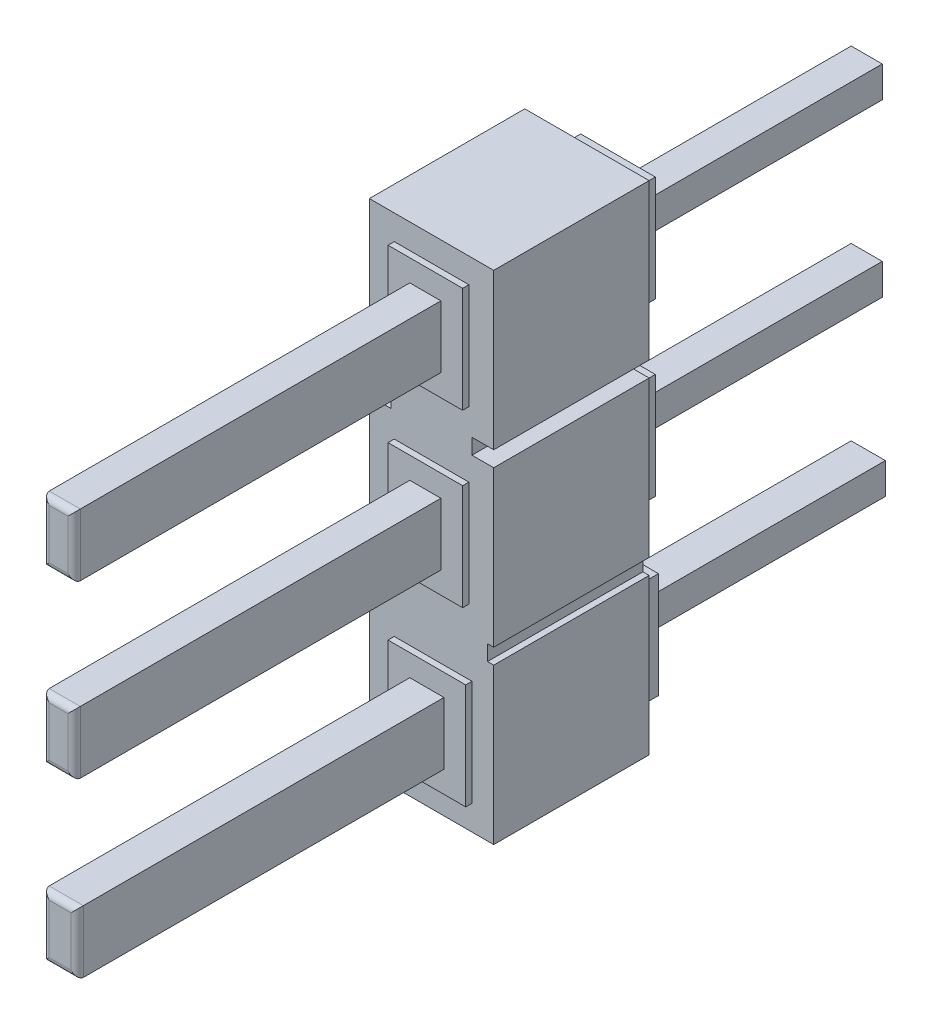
ISO-10303-21;
HEADER;
FILE_DESCRIPTION(('STEP AP214'),'2;1');
FILE_NAME('part.step','',(''),(''),'','','');
FILE_SCHEMA(('AUTOMOTIVE_DESIGN { 1 0 10303 214 1 1 1 1 }'));
ENDSEC;
DATA;
#1=APPLICATION_CONTEXT('core data for automotive mechanical design processes');
#2=APPLICATION_PROTOCOL_DEFINITION('international standard','automotive_design',2000,#1);
#3=PRODUCT_CONTEXT('',#1,'mechanical');
#4=PRODUCT('Part','Part','',(#3));
#5=PRODUCT_RELATED_PRODUCT_CATEGORY('part','',(#4));
#6=PRODUCT_DEFINITION_FORMATION('','',#4);
#7=PRODUCT_DEFINITION_CONTEXT('part definition',#1,'design');
#8=PRODUCT_DEFINITION('design','',#6,#7);
#9=PRODUCT_DEFINITION_SHAPE('','',#8);
#10=(LENGTH_UNIT() NAMED_UNIT(*) SI_UNIT(.MILLI.,.METRE.));
#11=(NAMED_UNIT(*) PLANE_ANGLE_UNIT() SI_UNIT($,.RADIAN.));
#12=(NAMED_UNIT(*) SI_UNIT($,.STERADIAN.) SOLID_ANGLE_UNIT());
#13=UNCERTAINTY_MEASURE_WITH_UNIT(LENGTH_MEASURE(1.E-05),#10,'distance_accuracy_value','');
#14=(GEOMETRIC_REPRESENTATION_CONTEXT(3) GLOBAL_UNCERTAINTY_ASSIGNED_CONTEXT((#13)) GLOBAL_UNIT_ASSIGNED_CONTEXT((#10,
#11,#12)) REPRESENTATION_CONTEXT('',''));
#15=CARTESIAN_POINT('',(0.,0.,0.));
#16=DIRECTION('',(0.,0.,1.));
#17=DIRECTION('',(1.,0.,0.));
#18=AXIS2_PLACEMENT_3D('',#15,#16,#17);
#19=CARTESIAN_POINT('',(-0.25,2.25,-0.5));
#20=DIRECTION('',(-1.,0.,0.));
#21=DIRECTION('',(0.,0.,1.));
#22=AXIS2_PLACEMENT_3D('',#19,#20,#21);
#23=PLANE('',#22);
#24=DIRECTION('',(0.,1.,0.));
#25=VECTOR('',#24,1.);
#26=CARTESIAN_POINT('',(-0.25,2.25,-4.5));
#27=LINE('',#26,#25);
#28=CARTESIAN_POINT('',(-0.25,2.5,-4.5));
#29=VERTEX_POINT('',#28);
#30=CARTESIAN_POINT('',(-0.249999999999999,3.,-4.5));
#31=VERTEX_POINT('',#30);
#32=EDGE_CURVE('E508',#29,#31,#27,.T.);
#33=ORIENTED_EDGE('',*,*,#32,.F.);
#34=DIRECTION('',(0.,0.,-1.));
#35=VECTOR('',#34,1.);
#36=CARTESIAN_POINT('',(-0.249999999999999,2.5,0.104152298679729));
#37=LINE('',#36,#35);
#38=CARTESIAN_POINT('',(-0.249999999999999,2.5,-0.5));
#39=VERTEX_POINT('',#38);
#40=EDGE_CURVE('E46',#39,#29,#37,.T.);
#41=ORIENTED_EDGE('',*,*,#40,.F.);
#42=DIRECTION('',(0.,1.,0.));
#43=VECTOR('',#42,1.);
#44=CARTESIAN_POINT('',(-0.25,2.25,-0.5));
#45=LINE('',#44,#43);
#46=CARTESIAN_POINT('',(-0.249999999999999,3.,-0.5));
#47=VERTEX_POINT('',#46);
#48=EDGE_CURVE('E518',#39,#47,#45,.T.);
#49=ORIENTED_EDGE('',*,*,#48,.T.);
#50=DIRECTION('',(0.,0.,-1.));
#51=VECTOR('',#50,1.);
#52=CARTESIAN_POINT('',(-0.249999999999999,3.,0.104152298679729));
#53=LINE('',#52,#51);
#54=EDGE_CURVE('E2009',#47,#31,#53,.T.);
#55=ORIENTED_EDGE('',*,*,#54,.T.);
#56=EDGE_LOOP('',(#33,#41,#49,#55));
#57=FACE_BOUND('',#56,.T.);
#58=ADVANCED_FACE('F31',(#57),#23,.T.);
#59=CARTESIAN_POINT('',(0.25,3.25,-0.5));
#60=DIRECTION('',(1.,0.,0.));
#61=DIRECTION('',(0.,1.,0.));
#62=AXIS2_PLACEMENT_3D('',#59,#60,#61);
#63=PLANE('',#62);
#64=DIRECTION('',(0.,-1.,0.));
#65=VECTOR('',#64,1.);
#66=CARTESIAN_POINT('',(0.25,3.25,-0.5));
#67=LINE('',#66,#65);
#68=CARTESIAN_POINT('',(0.25,3.,-0.5));
#69=VERTEX_POINT('',#68);
#70=CARTESIAN_POINT('',(0.25,2.5,-0.5));
#71=VERTEX_POINT('',#70);
#72=EDGE_CURVE('E504',#69,#71,#67,.T.);
#73=ORIENTED_EDGE('',*,*,#72,.T.);
#74=DIRECTION('',(0.,0.,-1.));
#75=VECTOR('',#74,1.);
#76=CARTESIAN_POINT('',(0.25,2.5,0.104152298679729));
#77=LINE('',#76,#75);
#78=CARTESIAN_POINT('',(0.25,2.5,-4.5));
#79=VERTEX_POINT('',#78);
#80=EDGE_CURVE('E493',#71,#79,#77,.T.);
#81=ORIENTED_EDGE('',*,*,#80,.T.);
#82=DIRECTION('',(0.,-1.,0.));
#83=VECTOR('',#82,1.);
#84=CARTESIAN_POINT('',(0.25,3.25,-4.5));
#85=LINE('',#84,#83);
#86=CARTESIAN_POINT('',(0.25,3.,-4.5));
#87=VERTEX_POINT('',#86);
#88=EDGE_CURVE('E502',#87,#79,#85,.T.);
#89=ORIENTED_EDGE('',*,*,#88,.F.);
#90=DIRECTION('',(0.,0.,-1.));
#91=VECTOR('',#90,1.);
#92=CARTESIAN_POINT('',(0.25,3.,0.104152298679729));
#93=LINE('',#92,#91);
#94=EDGE_CURVE('E54',#69,#87,#93,.T.);
#95=ORIENTED_EDGE('',*,*,#94,.F.);
#96=EDGE_LOOP('',(#73,#81,#89,#95));
#97=FACE_BOUND('',#96,.T.);
#98=ADVANCED_FACE('F501',(#97),#63,.T.);
#99=CARTESIAN_POINT('',(-6.55546844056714,0.,-4.5));
#100=DIRECTION('',(0.,0.,-1.));
#101=DIRECTION('',(-1.,0.,0.));
#102=AXIS2_PLACEMENT_3D('',#99,#100,#101);
#103=PLANE('',#102);
#104=ORIENTED_EDGE('',*,*,#88,.T.);
#105=DIRECTION('',(-1.,0.,0.));
#106=VECTOR('',#105,1.);
#107=CARTESIAN_POINT('',(-5.50476266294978,2.5,-4.5));
#108=LINE('',#107,#106);
#109=EDGE_CURVE('E490',#79,#29,#108,.T.);
#110=ORIENTED_EDGE('',*,*,#109,.T.);
#111=ORIENTED_EDGE('',*,*,#32,.T.);
#112=DIRECTION('',(-1.,0.,0.));
#113=VECTOR('',#112,1.);
#114=CARTESIAN_POINT('',(-5.50476266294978,3.,-4.5));
#115=LINE('',#114,#113);
#116=EDGE_CURVE('E507',#87,#31,#115,.T.);
#117=ORIENTED_EDGE('',*,*,#116,.F.);
#118=EDGE_LOOP('',(#104,#110,#111,#117));
#119=FACE_BOUND('',#118,.T.);
#120=ADVANCED_FACE('F506',(#119),#103,.T.);
#121=CARTESIAN_POINT('',(-0.25,-0.500000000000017,-0.5));
#122=DIRECTION('',(-1.,0.,0.));
#123=DIRECTION('',(0.,0.,1.));
#124=AXIS2_PLACEMENT_3D('',#121,#122,#123);
#125=PLANE('',#124);
#126=DIRECTION('',(0.,0.,-1.));
#127=VECTOR('',#126,1.);
#128=CARTESIAN_POINT('',(-0.249999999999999,0.25,0.104152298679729));
#129=LINE('',#128,#127);
#130=CARTESIAN_POINT('',(-0.249999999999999,0.25,-0.5));
#131=VERTEX_POINT('',#130);
#132=CARTESIAN_POINT('',(-0.249999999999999,0.25,-4.5));
#133=VERTEX_POINT('',#132);
#134=EDGE_CURVE('E2023',#131,#133,#129,.T.);
#135=ORIENTED_EDGE('',*,*,#134,.T.);
#136=DIRECTION('',(0.,1.,0.));
#137=VECTOR('',#136,1.);
#138=CARTESIAN_POINT('',(-0.25,-0.500000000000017,-4.5));
#139=LINE('',#138,#137);
#140=CARTESIAN_POINT('',(-0.25,-0.25,-4.5));
#141=VERTEX_POINT('',#140);
#142=EDGE_CURVE('E980',#141,#133,#139,.T.);
#143=ORIENTED_EDGE('',*,*,#142,.F.);
#144=DIRECTION('',(0.,0.,-1.));
#145=VECTOR('',#144,1.);
#146=CARTESIAN_POINT('',(-0.249999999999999,-0.25,0.104152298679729));
#147=LINE('',#146,#145);
#148=CARTESIAN_POINT('',(-0.249999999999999,-0.25,-0.5));
#149=VERTEX_POINT('',#148);
#150=EDGE_CURVE('E2034',#149,#141,#147,.T.);
#151=ORIENTED_EDGE('',*,*,#150,.F.);
#152=DIRECTION('',(0.,1.,0.));
#153=VECTOR('',#152,1.);
#154=CARTESIAN_POINT('',(-0.25,-0.500000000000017,-0.5));
#155=LINE('',#154,#153);
#156=EDGE_CURVE('E985',#149,#131,#155,.T.);
#157=ORIENTED_EDGE('',*,*,#156,.T.);
#158=EDGE_LOOP('',(#135,#143,#151,#157));
#159=FACE_BOUND('',#158,.T.);
#160=ADVANCED_FACE('F1120',(#159),#125,.T.);
#161=CARTESIAN_POINT('',(0.25,0.5,-0.5));
#162=DIRECTION('',(1.,0.,0.));
#163=DIRECTION('',(0.,1.,0.));
#164=AXIS2_PLACEMENT_3D('',#161,#162,#163);
#165=PLANE('',#164);
#166=DIRECTION('',(0.,0.,-1.));
#167=VECTOR('',#166,1.);
#168=CARTESIAN_POINT('',(0.25,0.25,0.104152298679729));
#169=LINE('',#168,#167);
#170=CARTESIAN_POINT('',(0.25,0.25,-0.5));
#171=VERTEX_POINT('',#170);
#172=CARTESIAN_POINT('',(0.25,0.25,-4.5));
#173=VERTEX_POINT('',#172);
#174=EDGE_CURVE('E2022',#171,#173,#169,.T.);
#175=ORIENTED_EDGE('',*,*,#174,.F.);
#176=DIRECTION('',(0.,-1.,0.));
#177=VECTOR('',#176,1.);
#178=CARTESIAN_POINT('',(0.25,0.5,-0.5));
#179=LINE('',#178,#177);
#180=CARTESIAN_POINT('',(0.249999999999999,-0.25,-0.5));
#181=VERTEX_POINT('',#180);
#182=EDGE_CURVE('E983',#171,#181,#179,.T.);
#183=ORIENTED_EDGE('',*,*,#182,.T.);
#184=DIRECTION('',(0.,0.,-1.));
#185=VECTOR('',#184,1.);
#186=CARTESIAN_POINT('',(0.249999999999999,-0.25,0.104152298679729));
#187=LINE('',#186,#185);
#188=CARTESIAN_POINT('',(0.249999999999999,-0.25,-4.5));
#189=VERTEX_POINT('',#188);
#190=EDGE_CURVE('E2037',#181,#189,#187,.T.);
#191=ORIENTED_EDGE('',*,*,#190,.T.);
#192=DIRECTION('',(0.,-1.,0.));
#193=VECTOR('',#192,1.);
#194=CARTESIAN_POINT('',(0.25,0.5,-4.5));
#195=LINE('',#194,#193);
#196=EDGE_CURVE('E978',#173,#189,#195,.T.);
#197=ORIENTED_EDGE('',*,*,#196,.F.);
#198=EDGE_LOOP('',(#175,#183,#191,#197));
#199=FACE_BOUND('',#198,.T.);
#200=ADVANCED_FACE('F1337',(#199),#165,.T.);
#201=CARTESIAN_POINT('',(-6.55546844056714,0.,-4.5));
#202=DIRECTION('',(0.,0.,-1.));
#203=DIRECTION('',(-1.,0.,0.));
#204=AXIS2_PLACEMENT_3D('',#201,#202,#203);
#205=PLANE('',#204);
#206=DIRECTION('',(-1.,0.,0.));
#207=VECTOR('',#206,1.);
#208=CARTESIAN_POINT('',(-5.50476266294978,0.249999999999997,-4.5));
#209=LINE('',#208,#207);
#210=EDGE_CURVE('E2011',#173,#133,#209,.T.);
#211=ORIENTED_EDGE('',*,*,#210,.F.);
#212=ORIENTED_EDGE('',*,*,#196,.T.);
#213=DIRECTION('',(-1.,0.,0.));
#214=VECTOR('',#213,1.);
#215=CARTESIAN_POINT('',(-5.50476266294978,-0.249999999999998,-4.5));
#216=LINE('',#215,#214);
#217=EDGE_CURVE('E2029',#189,#141,#216,.T.);
#218=ORIENTED_EDGE('',*,*,#217,.T.);
#219=ORIENTED_EDGE('',*,*,#142,.T.);
#220=EDGE_LOOP('',(#211,#212,#218,#219));
#221=FACE_BOUND('',#220,.T.);
#222=ADVANCED_FACE('F1341',(#221),#205,.T.);
#223=CARTESIAN_POINT('',(-0.25,-3.25,-0.5));
#224=DIRECTION('',(-1.,0.,0.));
#225=DIRECTION('',(0.,0.,1.));
#226=AXIS2_PLACEMENT_3D('',#223,#224,#225);
#227=PLANE('',#226);
#228=DIRECTION('',(0.,0.,-1.));
#229=VECTOR('',#228,1.);
#230=CARTESIAN_POINT('',(-0.249999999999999,-2.5,0.104152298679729));
#231=LINE('',#230,#229);
#232=CARTESIAN_POINT('',(-0.249999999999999,-2.5,-0.5));
#233=VERTEX_POINT('',#232);
#234=CARTESIAN_POINT('',(-0.249999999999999,-2.5,-4.5));
#235=VERTEX_POINT('',#234);
#236=EDGE_CURVE('E2043',#233,#235,#231,.T.);
#237=ORIENTED_EDGE('',*,*,#236,.T.);
#238=DIRECTION('',(0.,1.,0.));
#239=VECTOR('',#238,1.);
#240=CARTESIAN_POINT('',(-0.25,-3.25,-4.5));
#241=LINE('',#240,#239);
#242=CARTESIAN_POINT('',(-0.25,-3.,-4.5));
#243=VERTEX_POINT('',#242);
#244=EDGE_CURVE('E920',#243,#235,#241,.T.);
#245=ORIENTED_EDGE('',*,*,#244,.F.);
#246=DIRECTION('',(0.,0.,-1.));
#247=VECTOR('',#246,1.);
#248=CARTESIAN_POINT('',(-0.249999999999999,-3.,0.104152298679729));
#249=LINE('',#248,#247);
#250=CARTESIAN_POINT('',(-0.249999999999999,-3.,-0.5));
#251=VERTEX_POINT('',#250);
#252=EDGE_CURVE('E838',#251,#243,#249,.T.);
#253=ORIENTED_EDGE('',*,*,#252,.F.);
#254=DIRECTION('',(0.,1.,0.));
#255=VECTOR('',#254,1.);
#256=CARTESIAN_POINT('',(-0.25,-3.25,-0.5));
#257=LINE('',#256,#255);
#258=EDGE_CURVE('E925',#251,#233,#257,.T.);
#259=ORIENTED_EDGE('',*,*,#258,.T.);
#260=EDGE_LOOP('',(#237,#245,#253,#259));
#261=FACE_BOUND('',#260,.T.);
#262=ADVANCED_FACE('F1349',(#261),#227,.T.);
#263=CARTESIAN_POINT('',(0.300000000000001,-2.25,-0.5));
#264=DIRECTION('',(1.,0.,0.));
#265=DIRECTION('',(0.,1.,0.));
#266=AXIS2_PLACEMENT_3D('',#263,#264,#265);
#267=PLANE('',#266);
#268=DIRECTION('',(0.,0.,-1.));
#269=VECTOR('',#268,1.);
#270=CARTESIAN_POINT('',(0.300000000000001,-2.5,0.104152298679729));
#271=LINE('',#270,#269);
#272=CARTESIAN_POINT('',(0.300000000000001,-2.5,-0.5));
#273=VERTEX_POINT('',#272);
#274=CARTESIAN_POINT('',(0.300000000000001,-2.5,-4.5));
#275=VERTEX_POINT('',#274);
#276=EDGE_CURVE('E2042',#273,#275,#271,.T.);
#277=ORIENTED_EDGE('',*,*,#276,.F.);
#278=DIRECTION('',(0.,-1.,0.));
#279=VECTOR('',#278,1.);
#280=CARTESIAN_POINT('',(0.300000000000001,-2.25,-0.5));
#281=LINE('',#280,#279);
#282=CARTESIAN_POINT('',(0.300000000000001,-3.,-0.5));
#283=VERTEX_POINT('',#282);
#284=EDGE_CURVE('E923',#273,#283,#281,.T.);
#285=ORIENTED_EDGE('',*,*,#284,.T.);
#286=DIRECTION('',(0.,0.,-1.));
#287=VECTOR('',#286,1.);
#288=CARTESIAN_POINT('',(0.300000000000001,-3.,0.104152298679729));
#289=LINE('',#288,#287);
#290=CARTESIAN_POINT('',(0.300000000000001,-3.,-4.5));
#291=VERTEX_POINT('',#290);
#292=EDGE_CURVE('E841',#283,#291,#289,.T.);
#293=ORIENTED_EDGE('',*,*,#292,.T.);
#294=DIRECTION('',(0.,-1.,0.));
#295=VECTOR('',#294,1.);
#296=CARTESIAN_POINT('',(0.300000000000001,-2.25,-4.5));
#297=LINE('',#296,#295);
#298=EDGE_CURVE('E918',#275,#291,#297,.T.);
#299=ORIENTED_EDGE('',*,*,#298,.F.);
#300=EDGE_LOOP('',(#277,#285,#293,#299));
#301=FACE_BOUND('',#300,.T.);
#302=ADVANCED_FACE('F1527',(#301),#267,.T.);
#303=CARTESIAN_POINT('',(-6.55546844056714,0.,-4.5));
#304=DIRECTION('',(0.,0.,-1.));
#305=DIRECTION('',(-1.,0.,0.));
#306=AXIS2_PLACEMENT_3D('',#303,#304,#305);
#307=PLANE('',#306);
#308=DIRECTION('',(-1.,0.,0.));
#309=VECTOR('',#308,1.);
#310=CARTESIAN_POINT('',(-5.50476266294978,-2.5,-4.5));
#311=LINE('',#310,#309);
#312=EDGE_CURVE('E2033',#275,#235,#311,.T.);
#313=ORIENTED_EDGE('',*,*,#312,.F.);
#314=ORIENTED_EDGE('',*,*,#298,.T.);
#315=DIRECTION('',(-1.,0.,0.));
#316=VECTOR('',#315,1.);
#317=CARTESIAN_POINT('',(-5.50476266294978,-3.,-4.5));
#318=LINE('',#317,#316);
#319=EDGE_CURVE('E2048',#291,#243,#318,.T.);
#320=ORIENTED_EDGE('',*,*,#319,.T.);
#321=ORIENTED_EDGE('',*,*,#244,.T.);
#322=EDGE_LOOP('',(#313,#314,#320,#321));
#323=FACE_BOUND('',#322,.T.);
#324=ADVANCED_FACE('F1521',(#323),#307,.T.);
#325=CARTESIAN_POINT('',(0.650000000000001,-1.9,2.6));
#326=DIRECTION('',(0.,0.,1.));
#327=DIRECTION('',(1.,0.,0.));
#328=AXIS2_PLACEMENT_3D('',#325,#326,#327);
#329=PLANE('',#328);
#330=DIRECTION('',(0.,1.,0.));
#331=VECTOR('',#330,1.);
#332=CARTESIAN_POINT('',(0.650000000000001,-3.6,2.6));
#333=LINE('',#332,#331);
#334=CARTESIAN_POINT('',(0.650000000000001,-3.6,2.6));
#335=VERTEX_POINT('',#334);
#336=CARTESIAN_POINT('',(0.650000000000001,-1.9,2.6));
#337=VERTEX_POINT('',#336);
#338=EDGE_CURVE('E957',#335,#337,#333,.T.);
#339=ORIENTED_EDGE('',*,*,#338,.T.);
#340=DIRECTION('',(-1.,0.,0.));
#341=VECTOR('',#340,1.);
#342=CARTESIAN_POINT('',(0.650000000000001,-1.9,2.6));
#343=LINE('',#342,#341);
#344=CARTESIAN_POINT('',(-0.6,-1.9,2.6));
#345=VERTEX_POINT('',#344);
#346=EDGE_CURVE('E960',#337,#345,#343,.T.);
#347=ORIENTED_EDGE('',*,*,#346,.T.);
#348=DIRECTION('',(0.,-1.,0.));
#349=VECTOR('',#348,1.);
#350=CARTESIAN_POINT('',(-0.6,-1.9,2.6));
#351=LINE('',#350,#349);
#352=CARTESIAN_POINT('',(-0.6,-3.6,2.6));
#353=VERTEX_POINT('',#352);
#354=EDGE_CURVE('E962',#345,#353,#351,.T.);
#355=ORIENTED_EDGE('',*,*,#354,.T.);
#356=DIRECTION('',(1.,0.,0.));
#357=VECTOR('',#356,1.);
#358=CARTESIAN_POINT('',(-0.6,-3.6,2.6));
#359=LINE('',#358,#357);
#360=EDGE_CURVE('E964',#353,#335,#359,.T.);
#361=ORIENTED_EDGE('',*,*,#360,.T.);
#362=EDGE_LOOP('',(#339,#347,#355,#361));
#363=FACE_BOUND('',#362,.T.);
#364=DIRECTION('',(0.,1.,0.));
#365=VECTOR('',#364,1.);
#366=CARTESIAN_POINT('',(0.3,-3.25,2.6));
#367=LINE('',#366,#365);
#368=CARTESIAN_POINT('',(0.3,-3.25,2.6));
#369=VERTEX_POINT('',#368);
#370=CARTESIAN_POINT('',(0.300000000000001,-2.25,2.6));
#371=VERTEX_POINT('',#370);
#372=EDGE_CURVE('E866',#369,#371,#367,.T.);
#373=ORIENTED_EDGE('',*,*,#372,.F.);
#374=DIRECTION('',(1.,0.,0.));
#375=VECTOR('',#374,1.);
#376=CARTESIAN_POINT('',(-0.25,-3.25,2.6));
#377=LINE('',#376,#375);
#378=CARTESIAN_POINT('',(-0.25,-3.25,2.6));
#379=VERTEX_POINT('',#378);
#380=EDGE_CURVE('E815',#379,#369,#377,.T.);
#381=ORIENTED_EDGE('',*,*,#380,.F.);
#382=DIRECTION('',(0.,-1.,0.));
#383=VECTOR('',#382,1.);
#384=CARTESIAN_POINT('',(-0.25,-2.25,2.6));
#385=LINE('',#384,#383);
#386=CARTESIAN_POINT('',(-0.25,-2.25,2.6));
#387=VERTEX_POINT('',#386);
#388=EDGE_CURVE('E871',#387,#379,#385,.T.);
#389=ORIENTED_EDGE('',*,*,#388,.F.);
#390=DIRECTION('',(-1.,0.,0.));
#391=VECTOR('',#390,1.);
#392=CARTESIAN_POINT('',(0.300000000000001,-2.25,2.6));
#393=LINE('',#392,#391);
#394=EDGE_CURVE('E868',#371,#387,#393,.T.);
#395=ORIENTED_EDGE('',*,*,#394,.F.);
#396=EDGE_LOOP('',(#373,#381,#389,#395));
#397=FACE_BOUND('',#396,.T.);
#398=ADVANCED_FACE('F1055',(#363,#397),#329,.T.);
#399=CARTESIAN_POINT('',(0.6,0.85,2.6));
#400=DIRECTION('',(0.,0.,1.));
#401=DIRECTION('',(1.,0.,0.));
#402=AXIS2_PLACEMENT_3D('',#399,#400,#401);
#403=PLANE('',#402);
#404=DIRECTION('',(0.,1.,0.));
#405=VECTOR('',#404,1.);
#406=CARTESIAN_POINT('',(0.6,-0.850000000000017,2.6));
#407=LINE('',#406,#405);
#408=CARTESIAN_POINT('',(0.6,-0.850000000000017,2.6));
#409=VERTEX_POINT('',#408);
#410=CARTESIAN_POINT('',(0.6,0.85,2.6));
#411=VERTEX_POINT('',#410);
#412=EDGE_CURVE('E1017',#409,#411,#407,.T.);
#413=ORIENTED_EDGE('',*,*,#412,.T.);
#414=DIRECTION('',(-1.,0.,0.));
#415=VECTOR('',#414,1.);
#416=CARTESIAN_POINT('',(0.6,0.85,2.6));
#417=LINE('',#416,#415);
#418=CARTESIAN_POINT('',(-0.6,0.85,2.6));
#419=VERTEX_POINT('',#418);
#420=EDGE_CURVE('E1020',#411,#419,#417,.T.);
#421=ORIENTED_EDGE('',*,*,#420,.T.);
#422=DIRECTION('',(0.,-1.,0.));
#423=VECTOR('',#422,1.);
#424=CARTESIAN_POINT('',(-0.6,0.85,2.6));
#425=LINE('',#424,#423);
#426=CARTESIAN_POINT('',(-0.6,-0.850000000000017,2.6));
#427=VERTEX_POINT('',#426);
#428=EDGE_CURVE('E1022',#419,#427,#425,.T.);
#429=ORIENTED_EDGE('',*,*,#428,.T.);
#430=DIRECTION('',(1.,0.,0.));
#431=VECTOR('',#430,1.);
#432=CARTESIAN_POINT('',(-0.6,-0.850000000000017,2.6));
#433=LINE('',#432,#431);
#434=EDGE_CURVE('E1024',#427,#409,#433,.T.);
#435=ORIENTED_EDGE('',*,*,#434,.T.);
#436=EDGE_LOOP('',(#413,#421,#429,#435));
#437=FACE_BOUND('',#436,.T.);
#438=DIRECTION('',(0.,1.,0.));
#439=VECTOR('',#438,1.);
#440=CARTESIAN_POINT('',(0.249999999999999,-0.500000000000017,2.6));
#441=LINE('',#440,#439);
#442=CARTESIAN_POINT('',(0.249999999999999,-0.500000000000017,2.6));
#443=VERTEX_POINT('',#442);
#444=CARTESIAN_POINT('',(0.25,0.5,2.6));
#445=VERTEX_POINT('',#444);
#446=EDGE_CURVE('E881',#443,#445,#441,.T.);
#447=ORIENTED_EDGE('',*,*,#446,.F.);
#448=DIRECTION('',(1.,0.,0.));
#449=VECTOR('',#448,1.);
#450=CARTESIAN_POINT('',(-0.25,-0.500000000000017,2.6));
#451=LINE('',#450,#449);
#452=CARTESIAN_POINT('',(-0.25,-0.500000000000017,2.6));
#453=VERTEX_POINT('',#452);
#454=EDGE_CURVE('E817',#453,#443,#451,.T.);
#455=ORIENTED_EDGE('',*,*,#454,.F.);
#456=DIRECTION('',(0.,-1.,0.));
#457=VECTOR('',#456,1.);
#458=CARTESIAN_POINT('',(-0.25,0.5,2.6));
#459=LINE('',#458,#457);
#460=CARTESIAN_POINT('',(-0.25,0.5,2.6));
#461=VERTEX_POINT('',#460);
#462=EDGE_CURVE('E887',#461,#453,#459,.T.);
#463=ORIENTED_EDGE('',*,*,#462,.F.);
#464=DIRECTION('',(-1.,0.,0.));
#465=VECTOR('',#464,1.);
#466=CARTESIAN_POINT('',(0.25,0.5,2.6));
#467=LINE('',#466,#465);
#468=EDGE_CURVE('E884',#445,#461,#467,.T.);
#469=ORIENTED_EDGE('',*,*,#468,.F.);
#470=EDGE_LOOP('',(#447,#455,#463,#469));
#471=FACE_BOUND('',#470,.T.);
#472=ADVANCED_FACE('F1051',(#437,#471),#403,.T.);
#473=CARTESIAN_POINT('',(-0.600000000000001,3.6,2.6));
#474=DIRECTION('',(0.,0.,1.));
#475=DIRECTION('',(1.,0.,0.));
#476=AXIS2_PLACEMENT_3D('',#473,#474,#475);
#477=PLANE('',#476);
#478=DIRECTION('',(-1.,0.,0.));
#479=VECTOR('',#478,1.);
#480=CARTESIAN_POINT('',(0.6,3.6,2.6));
#481=LINE('',#480,#479);
#482=CARTESIAN_POINT('',(0.6,3.6,2.6));
#483=VERTEX_POINT('',#482);
#484=CARTESIAN_POINT('',(-0.600000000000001,3.6,2.6));
#485=VERTEX_POINT('',#484);
#486=EDGE_CURVE('E549',#483,#485,#481,.T.);
#487=ORIENTED_EDGE('',*,*,#486,.T.);
#488=DIRECTION('',(0.,-1.,0.));
#489=VECTOR('',#488,1.);
#490=CARTESIAN_POINT('',(-0.600000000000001,3.6,2.6));
#491=LINE('',#490,#489);
#492=CARTESIAN_POINT('',(-0.600000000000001,1.9,2.6));
#493=VERTEX_POINT('',#492);
#494=EDGE_CURVE('E552',#485,#493,#491,.T.);
#495=ORIENTED_EDGE('',*,*,#494,.T.);
#496=DIRECTION('',(1.,0.,0.));
#497=VECTOR('',#496,1.);
#498=CARTESIAN_POINT('',(-0.600000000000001,1.9,2.6));
#499=LINE('',#498,#497);
#500=CARTESIAN_POINT('',(0.600000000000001,1.9,2.6));
#501=VERTEX_POINT('',#500);
#502=EDGE_CURVE('E554',#493,#501,#499,.T.);
#503=ORIENTED_EDGE('',*,*,#502,.T.);
#504=DIRECTION('',(0.,1.,0.));
#505=VECTOR('',#504,1.);
#506=CARTESIAN_POINT('',(0.600000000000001,1.9,2.6));
#507=LINE('',#506,#505);
#508=EDGE_CURVE('E556',#501,#483,#507,.T.);
#509=ORIENTED_EDGE('',*,*,#508,.T.);
#510=EDGE_LOOP('',(#487,#495,#503,#509));
#511=FACE_BOUND('',#510,.T.);
#512=DIRECTION('',(0.,1.,0.));
#513=VECTOR('',#512,1.);
#514=CARTESIAN_POINT('',(0.25,2.25,2.6));
#515=LINE('',#514,#513);
#516=CARTESIAN_POINT('',(0.25,2.25,2.6));
#517=VERTEX_POINT('',#516);
#518=CARTESIAN_POINT('',(0.25,3.25,2.6));
#519=VERTEX_POINT('',#518);
#520=EDGE_CURVE('E901',#517,#519,#515,.T.);
#521=ORIENTED_EDGE('',*,*,#520,.F.);
#522=DIRECTION('',(1.,0.,0.));
#523=VECTOR('',#522,1.);
#524=CARTESIAN_POINT('',(-0.25,2.25,2.6));
#525=LINE('',#524,#523);
#526=CARTESIAN_POINT('',(-0.25,2.25,2.6));
#527=VERTEX_POINT('',#526);
#528=EDGE_CURVE('E898',#527,#517,#525,.T.);
#529=ORIENTED_EDGE('',*,*,#528,.F.);
#530=DIRECTION('',(0.,-1.,0.));
#531=VECTOR('',#530,1.);
#532=CARTESIAN_POINT('',(-0.25,3.25,2.6));
#533=LINE('',#532,#531);
#534=CARTESIAN_POINT('',(-0.25,3.25,2.6));
#535=VERTEX_POINT('',#534);
#536=EDGE_CURVE('E907',#535,#527,#533,.T.);
#537=ORIENTED_EDGE('',*,*,#536,.F.);
#538=DIRECTION('',(-1.,0.,0.));
#539=VECTOR('',#538,1.);
#540=CARTESIAN_POINT('',(0.25,3.25,2.6));
#541=LINE('',#540,#539);
#542=EDGE_CURVE('E904',#519,#535,#541,.T.);
#543=ORIENTED_EDGE('',*,*,#542,.F.);
#544=EDGE_LOOP('',(#521,#529,#537,#543));
#545=FACE_BOUND('',#544,.T.);
#546=ADVANCED_FACE('F1054',(#511,#545),#477,.T.);
#547=CARTESIAN_POINT('',(-1.,1.5,2.5));
#548=DIRECTION('',(0.,0.,1.));
#549=DIRECTION('',(1.,0.,0.));
#550=AXIS2_PLACEMENT_3D('',#547,#548,#549);
#551=PLANE('',#550);
#552=DIRECTION('',(0.,-1.,0.));
#553=VECTOR('',#552,1.);
#554=CARTESIAN_POINT('',(-0.6,0.85,2.5));
#555=LINE('',#554,#553);
#556=CARTESIAN_POINT('',(-0.6,0.85,2.5));
#557=VERTEX_POINT('',#556);
#558=CARTESIAN_POINT('',(-0.6,-0.850000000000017,2.5));
#559=VERTEX_POINT('',#558);
#560=EDGE_CURVE('E585',#557,#559,#555,.T.);
#561=ORIENTED_EDGE('',*,*,#560,.F.);
#562=DIRECTION('',(-1.,0.,0.));
#563=VECTOR('',#562,1.);
#564=CARTESIAN_POINT('',(-0.6,0.85,2.5));
#565=LINE('',#564,#563);
#566=CARTESIAN_POINT('',(0.6,0.85,2.5));
#567=VERTEX_POINT('',#566);
#568=EDGE_CURVE('E582',#567,#557,#565,.T.);
#569=ORIENTED_EDGE('',*,*,#568,.F.);
#570=DIRECTION('',(0.,1.,0.));
#571=VECTOR('',#570,1.);
#572=CARTESIAN_POINT('',(0.6,0.85,2.5));
#573=LINE('',#572,#571);
#574=CARTESIAN_POINT('',(0.6,-0.850000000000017,2.5));
#575=VERTEX_POINT('',#574);
#576=EDGE_CURVE('E591',#575,#567,#573,.T.);
#577=ORIENTED_EDGE('',*,*,#576,.F.);
#578=DIRECTION('',(1.,0.,0.));
#579=VECTOR('',#578,1.);
#580=CARTESIAN_POINT('',(-0.6,-0.850000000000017,2.5));
#581=LINE('',#580,#579);
#582=EDGE_CURVE('E588',#559,#575,#581,.T.);
#583=ORIENTED_EDGE('',*,*,#582,.F.);
#584=EDGE_LOOP('',(#561,#569,#577,#583));
#585=FACE_BOUND('',#584,.T.);
#586=DIRECTION('',(0.,-1.,0.));
#587=VECTOR('',#586,1.);
#588=CARTESIAN_POINT('',(-1.,4.,2.5));
#589=LINE('',#588,#587);
#590=CARTESIAN_POINT('',(-1.,4.,2.5));
#591=VERTEX_POINT('',#590);
#592=CARTESIAN_POINT('',(-1.,1.5,2.5));
#593=VERTEX_POINT('',#592);
#594=EDGE_CURVE('E647',#591,#593,#589,.T.);
#595=ORIENTED_EDGE('',*,*,#594,.T.);
#596=DIRECTION('',(1.,0.,0.));
#597=VECTOR('',#596,1.);
#598=CARTESIAN_POINT('',(-1.,1.5,2.5));
#599=LINE('',#598,#597);
#600=CARTESIAN_POINT('',(-0.65,1.5,2.5));
#601=VERTEX_POINT('',#600);
#602=EDGE_CURVE('E650',#593,#601,#599,.T.);
#603=ORIENTED_EDGE('',*,*,#602,.T.);
#604=DIRECTION('',(0.,-1.,0.));
#605=VECTOR('',#604,1.);
#606=CARTESIAN_POINT('',(-0.65,1.5,2.5));
#607=LINE('',#606,#605);
#608=CARTESIAN_POINT('',(-0.65,1.25,2.5));
#609=VERTEX_POINT('',#608);
#610=EDGE_CURVE('E652',#601,#609,#607,.T.);
#611=ORIENTED_EDGE('',*,*,#610,.T.);
#612=DIRECTION('',(-1.,0.,0.));
#613=VECTOR('',#612,1.);
#614=CARTESIAN_POINT('',(-1.,1.25,2.5));
#615=LINE('',#614,#613);
#616=CARTESIAN_POINT('',(-1.,1.25,2.5));
#617=VERTEX_POINT('',#616);
#618=EDGE_CURVE('E654',#609,#617,#615,.T.);
#619=ORIENTED_EDGE('',*,*,#618,.T.);
#620=DIRECTION('',(0.,-1.,0.));
#621=VECTOR('',#620,1.);
#622=CARTESIAN_POINT('',(-1.,1.25,2.5));
#623=LINE('',#622,#621);
#624=CARTESIAN_POINT('',(-1.,-1.25,2.5));
#625=VERTEX_POINT('',#624);
#626=EDGE_CURVE('E656',#617,#625,#623,.T.);
#627=ORIENTED_EDGE('',*,*,#626,.T.);
#628=DIRECTION('',(1.,0.,0.));
#629=VECTOR('',#628,1.);
#630=CARTESIAN_POINT('',(-1.,-1.25,2.5));
#631=LINE('',#630,#629);
#632=CARTESIAN_POINT('',(-0.9,-1.25,2.5));
#633=VERTEX_POINT('',#632);
#634=EDGE_CURVE('E658',#625,#633,#631,.T.);
#635=ORIENTED_EDGE('',*,*,#634,.T.);
#636=DIRECTION('',(0.,-1.,0.));
#637=VECTOR('',#636,1.);
#638=CARTESIAN_POINT('',(-0.9,-1.25,2.5));
#639=LINE('',#638,#637);
#640=CARTESIAN_POINT('',(-0.9,-1.5,2.5));
#641=VERTEX_POINT('',#640);
#642=EDGE_CURVE('E660',#633,#641,#639,.T.);
#643=ORIENTED_EDGE('',*,*,#642,.T.);
#644=DIRECTION('',(-1.,0.,0.));
#645=VECTOR('',#644,1.);
#646=CARTESIAN_POINT('',(-1.,-1.5,2.5));
#647=LINE('',#646,#645);
#648=CARTESIAN_POINT('',(-1.,-1.5,2.5));
#649=VERTEX_POINT('',#648);
#650=EDGE_CURVE('E662',#641,#649,#647,.T.);
#651=ORIENTED_EDGE('',*,*,#650,.T.);
#652=DIRECTION('',(0.,-1.,0.));
#653=VECTOR('',#652,1.);
#654=CARTESIAN_POINT('',(-1.,-1.5,2.5));
#655=LINE('',#654,#653);
#656=CARTESIAN_POINT('',(-1.,-4.,2.5));
#657=VERTEX_POINT('',#656);
#658=EDGE_CURVE('E664',#649,#657,#655,.T.);
#659=ORIENTED_EDGE('',*,*,#658,.T.);
#660=DIRECTION('',(1.,0.,0.));
#661=VECTOR('',#660,1.);
#662=CARTESIAN_POINT('',(-1.,-4.,2.5));
#663=LINE('',#662,#661);
#664=CARTESIAN_POINT('',(1.,-4.,2.5));
#665=VERTEX_POINT('',#664);
#666=EDGE_CURVE('E666',#657,#665,#663,.T.);
#667=ORIENTED_EDGE('',*,*,#666,.T.);
#668=DIRECTION('',(0.,1.,0.));
#669=VECTOR('',#668,1.);
#670=CARTESIAN_POINT('',(1.,-1.5,2.5));
#671=LINE('',#670,#669);
#672=CARTESIAN_POINT('',(1.,-1.5,2.5));
#673=VERTEX_POINT('',#672);
#674=EDGE_CURVE('E668',#665,#673,#671,.T.);
#675=ORIENTED_EDGE('',*,*,#674,.T.);
#676=DIRECTION('',(-1.,0.,0.));
#677=VECTOR('',#676,1.);
#678=CARTESIAN_POINT('',(1.,-1.5,2.5));
#679=LINE('',#678,#677);
#680=CARTESIAN_POINT('',(0.9,-1.5,2.5));
#681=VERTEX_POINT('',#680);
#682=EDGE_CURVE('E670',#673,#681,#679,.T.);
#683=ORIENTED_EDGE('',*,*,#682,.T.);
#684=DIRECTION('',(0.,1.,0.));
#685=VECTOR('',#684,1.);
#686=CARTESIAN_POINT('',(0.9,-1.25,2.5));
#687=LINE('',#686,#685);
#688=CARTESIAN_POINT('',(0.9,-1.25,2.5));
#689=VERTEX_POINT('',#688);
#690=EDGE_CURVE('E672',#681,#689,#687,.T.);
#691=ORIENTED_EDGE('',*,*,#690,.T.);
#692=DIRECTION('',(1.,0.,0.));
#693=VECTOR('',#692,1.);
#694=CARTESIAN_POINT('',(1.,-1.25,2.5));
#695=LINE('',#694,#693);
#696=CARTESIAN_POINT('',(1.,-1.25,2.5));
#697=VERTEX_POINT('',#696);
#698=EDGE_CURVE('E674',#689,#697,#695,.T.);
#699=ORIENTED_EDGE('',*,*,#698,.T.);
#700=DIRECTION('',(0.,1.,0.));
#701=VECTOR('',#700,1.);
#702=CARTESIAN_POINT('',(1.,1.25,2.5));
#703=LINE('',#702,#701);
#704=CARTESIAN_POINT('',(1.,1.25,2.5));
#705=VERTEX_POINT('',#704);
#706=EDGE_CURVE('E676',#697,#705,#703,.T.);
#707=ORIENTED_EDGE('',*,*,#706,.T.);
#708=DIRECTION('',(-1.,0.,0.));
#709=VECTOR('',#708,1.);
#710=CARTESIAN_POINT('',(1.,1.25,2.5));
#711=LINE('',#710,#709);
#712=CARTESIAN_POINT('',(0.65,1.25,2.5));
#713=VERTEX_POINT('',#712);
#714=EDGE_CURVE('E678',#705,#713,#711,.T.);
#715=ORIENTED_EDGE('',*,*,#714,.T.);
#716=DIRECTION('',(0.,1.,0.));
#717=VECTOR('',#716,1.);
#718=CARTESIAN_POINT('',(0.65,1.5,2.5));
#719=LINE('',#718,#717);
#720=CARTESIAN_POINT('',(0.65,1.5,2.5));
#721=VERTEX_POINT('',#720);
#722=EDGE_CURVE('E680',#713,#721,#719,.T.);
#723=ORIENTED_EDGE('',*,*,#722,.T.);
#724=DIRECTION('',(1.,0.,0.));
#725=VECTOR('',#724,1.);
#726=CARTESIAN_POINT('',(1.,1.5,2.5));
#727=LINE('',#726,#725);
#728=CARTESIAN_POINT('',(1.,1.5,2.5));
#729=VERTEX_POINT('',#728);
#730=EDGE_CURVE('E682',#721,#729,#727,.T.);
#731=ORIENTED_EDGE('',*,*,#730,.T.);
#732=DIRECTION('',(0.,1.,0.));
#733=VECTOR('',#732,1.);
#734=CARTESIAN_POINT('',(0.999999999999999,4.,2.5));
#735=LINE('',#734,#733);
#736=CARTESIAN_POINT('',(0.999999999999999,4.,2.5));
#737=VERTEX_POINT('',#736);
#738=EDGE_CURVE('E684',#729,#737,#735,.T.);
#739=ORIENTED_EDGE('',*,*,#738,.T.);
#740=DIRECTION('',(-1.,0.,0.));
#741=VECTOR('',#740,1.);
#742=CARTESIAN_POINT('',(-1.,4.,2.5));
#743=LINE('',#742,#741);
#744=EDGE_CURVE('E686',#737,#591,#743,.T.);
#745=ORIENTED_EDGE('',*,*,#744,.T.);
#746=EDGE_LOOP('',(#595,#603,#611,#619,#627,#635,#643,#651,#659,#667,#675,#683,#691,#699,#707,
#715,#723,#731,#739,#745));
#747=FACE_BOUND('',#746,.T.);
#748=DIRECTION('',(1.,0.,0.));
#749=VECTOR('',#748,1.);
#750=CARTESIAN_POINT('',(-0.6,1.9,2.5));
#751=LINE('',#750,#749);
#752=CARTESIAN_POINT('',(-0.6,1.9,2.5));
#753=VERTEX_POINT('',#752);
#754=CARTESIAN_POINT('',(0.6,1.9,2.5));
#755=VERTEX_POINT('',#754);
#756=EDGE_CURVE('E597',#753,#755,#751,.T.);
#757=ORIENTED_EDGE('',*,*,#756,.F.);
#758=DIRECTION('',(0.,-1.,0.));
#759=VECTOR('',#758,1.);
#760=CARTESIAN_POINT('',(-0.600000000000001,3.6,2.5));
#761=LINE('',#760,#759);
#762=CARTESIAN_POINT('',(-0.600000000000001,3.6,2.5));
#763=VERTEX_POINT('',#762);
#764=EDGE_CURVE('E594',#763,#753,#761,.T.);
#765=ORIENTED_EDGE('',*,*,#764,.F.);
#766=DIRECTION('',(-1.,0.,0.));
#767=VECTOR('',#766,1.);
#768=CARTESIAN_POINT('',(-0.600000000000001,3.6,2.5));
#769=LINE('',#768,#767);
#770=CARTESIAN_POINT('',(0.6,3.6,2.5));
#771=VERTEX_POINT('',#770);
#772=EDGE_CURVE('E603',#771,#763,#769,.T.);
#773=ORIENTED_EDGE('',*,*,#772,.F.);
#774=DIRECTION('',(0.,1.,0.));
#775=VECTOR('',#774,1.);
#776=CARTESIAN_POINT('',(0.6,3.6,2.5));
#777=LINE('',#776,#775);
#778=EDGE_CURVE('E600',#755,#771,#777,.T.);
#779=ORIENTED_EDGE('',*,*,#778,.F.);
#780=EDGE_LOOP('',(#757,#765,#773,#779));
#781=FACE_BOUND('',#780,.T.);
#782=DIRECTION('',(0.,-1.,0.));
#783=VECTOR('',#782,1.);
#784=CARTESIAN_POINT('',(-0.6,-1.9,2.5));
#785=LINE('',#784,#783);
#786=CARTESIAN_POINT('',(-0.6,-1.9,2.5));
#787=VERTEX_POINT('',#786);
#788=CARTESIAN_POINT('',(-0.6,-3.6,2.5));
#789=VERTEX_POINT('',#788);
#790=EDGE_CURVE('E573',#787,#789,#785,.T.);
#791=ORIENTED_EDGE('',*,*,#790,.F.);
#792=DIRECTION('',(-1.,0.,0.));
#793=VECTOR('',#792,1.);
#794=CARTESIAN_POINT('',(-0.6,-1.9,2.5));
#795=LINE('',#794,#793);
#796=CARTESIAN_POINT('',(0.65,-1.9,2.5));
#797=VERTEX_POINT('',#796);
#798=EDGE_CURVE('E570',#797,#787,#795,.T.);
#799=ORIENTED_EDGE('',*,*,#798,.F.);
#800=DIRECTION('',(0.,1.,0.));
#801=VECTOR('',#800,1.);
#802=CARTESIAN_POINT('',(0.65,-1.9,2.5));
#803=LINE('',#802,#801);
#804=CARTESIAN_POINT('',(0.650000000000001,-3.6,2.5));
#805=VERTEX_POINT('',#804);
#806=EDGE_CURVE('E579',#805,#797,#803,.T.);
#807=ORIENTED_EDGE('',*,*,#806,.F.);
#808=DIRECTION('',(1.,0.,0.));
#809=VECTOR('',#808,1.);
#810=CARTESIAN_POINT('',(-0.6,-3.6,2.5));
#811=LINE('',#810,#809);
#812=EDGE_CURVE('E576',#789,#805,#811,.T.);
#813=ORIENTED_EDGE('',*,*,#812,.F.);
#814=EDGE_LOOP('',(#791,#799,#807,#813));
#815=FACE_BOUND('',#814,.T.);
#816=ADVANCED_FACE('F1041',(#585,#747,#781,#815),#551,.T.);
#817=CARTESIAN_POINT('',(-1.,1.5,0.));
#818=DIRECTION('',(0.,0.,1.));
#819=DIRECTION('',(1.,0.,0.));
#820=AXIS2_PLACEMENT_3D('',#817,#818,#819);
#821=PLANE('',#820);
#822=DIRECTION('',(0.,1.,0.));
#823=VECTOR('',#822,1.);
#824=CARTESIAN_POINT('',(0.65,0.,0.));
#825=LINE('',#824,#823);
#826=CARTESIAN_POINT('',(0.650000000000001,-3.6,0.));
#827=VERTEX_POINT('',#826);
#828=CARTESIAN_POINT('',(0.650000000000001,-1.9,0.));
#829=VERTEX_POINT('',#828);
#830=EDGE_CURVE('E939',#827,#829,#825,.T.);
#831=ORIENTED_EDGE('',*,*,#830,.T.);
#832=DIRECTION('',(-1.,0.,0.));
#833=VECTOR('',#832,1.);
#834=CARTESIAN_POINT('',(-6.55546844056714,-1.9,0.));
#835=LINE('',#834,#833);
#836=CARTESIAN_POINT('',(-0.6,-1.9,0.));
#837=VERTEX_POINT('',#836);
#838=EDGE_CURVE('E936',#829,#837,#835,.T.);
#839=ORIENTED_EDGE('',*,*,#838,.T.);
#840=DIRECTION('',(0.,-1.,0.));
#841=VECTOR('',#840,1.);
#842=CARTESIAN_POINT('',(-0.6,0.,0.));
#843=LINE('',#842,#841);
#844=CARTESIAN_POINT('',(-0.599999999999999,-3.6,0.));
#845=VERTEX_POINT('',#844);
#846=EDGE_CURVE('E945',#837,#845,#843,.T.);
#847=ORIENTED_EDGE('',*,*,#846,.T.);
#848=DIRECTION('',(1.,0.,0.));
#849=VECTOR('',#848,1.);
#850=CARTESIAN_POINT('',(-6.55546844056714,-3.6,0.));
#851=LINE('',#850,#849);
#852=EDGE_CURVE('E942',#845,#827,#851,.T.);
#853=ORIENTED_EDGE('',*,*,#852,.T.);
#854=EDGE_LOOP('',(#831,#839,#847,#853));
#855=FACE_BOUND('',#854,.T.);
#856=DIRECTION('',(0.,1.,0.));
#857=VECTOR('',#856,1.);
#858=CARTESIAN_POINT('',(0.6,0.,0.));
#859=LINE('',#858,#857);
#860=CARTESIAN_POINT('',(0.6,-0.850000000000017,0.));
#861=VERTEX_POINT('',#860);
#862=CARTESIAN_POINT('',(0.6,0.85,0.));
#863=VERTEX_POINT('',#862);
#864=EDGE_CURVE('E999',#861,#863,#859,.T.);
#865=ORIENTED_EDGE('',*,*,#864,.T.);
#866=DIRECTION('',(-1.,0.,0.));
#867=VECTOR('',#866,1.);
#868=CARTESIAN_POINT('',(-6.55546844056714,0.849999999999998,0.));
#869=LINE('',#868,#867);
#870=CARTESIAN_POINT('',(-0.6,0.85,0.));
#871=VERTEX_POINT('',#870);
#872=EDGE_CURVE('E996',#863,#871,#869,.T.);
#873=ORIENTED_EDGE('',*,*,#872,.T.);
#874=DIRECTION('',(0.,-1.,0.));
#875=VECTOR('',#874,1.);
#876=CARTESIAN_POINT('',(-0.6,0.,0.));
#877=LINE('',#876,#875);
#878=CARTESIAN_POINT('',(-0.6,-0.850000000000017,0.));
#879=VERTEX_POINT('',#878);
#880=EDGE_CURVE('E1005',#871,#879,#877,.T.);
#881=ORIENTED_EDGE('',*,*,#880,.T.);
#882=DIRECTION('',(1.,0.,0.));
#883=VECTOR('',#882,1.);
#884=CARTESIAN_POINT('',(-6.55546844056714,-0.850000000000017,0.));
#885=LINE('',#884,#883);
#886=EDGE_CURVE('E1002',#879,#861,#885,.T.);
#887=ORIENTED_EDGE('',*,*,#886,.T.);
#888=EDGE_LOOP('',(#865,#873,#881,#887));
#889=FACE_BOUND('',#888,.T.);
#890=DIRECTION('',(-1.,0.,0.));
#891=VECTOR('',#890,1.);
#892=CARTESIAN_POINT('',(-6.55546844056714,3.6,0.));
#893=LINE('',#892,#891);
#894=CARTESIAN_POINT('',(0.6,3.6,0.));
#895=VERTEX_POINT('',#894);
#896=CARTESIAN_POINT('',(-0.600000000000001,3.6,0.));
#897=VERTEX_POINT('',#896);
#898=EDGE_CURVE('E531',#895,#897,#893,.T.);
#899=ORIENTED_EDGE('',*,*,#898,.T.);
#900=DIRECTION('',(0.,-1.,0.));
#901=VECTOR('',#900,1.);
#902=CARTESIAN_POINT('',(-0.6,0.,0.));
#903=LINE('',#902,#901);
#904=CARTESIAN_POINT('',(-0.600000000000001,1.9,0.));
#905=VERTEX_POINT('',#904);
#906=EDGE_CURVE('E528',#897,#905,#903,.T.);
#907=ORIENTED_EDGE('',*,*,#906,.T.);
#908=DIRECTION('',(1.,0.,0.));
#909=VECTOR('',#908,1.);
#910=CARTESIAN_POINT('',(-6.55546844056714,1.9,0.));
#911=LINE('',#910,#909);
#912=CARTESIAN_POINT('',(0.600000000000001,1.9,0.));
#913=VERTEX_POINT('',#912);
#914=EDGE_CURVE('E537',#905,#913,#911,.T.);
#915=ORIENTED_EDGE('',*,*,#914,.T.);
#916=DIRECTION('',(0.,1.,0.));
#917=VECTOR('',#916,1.);
#918=CARTESIAN_POINT('',(0.600000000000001,0.,0.));
#919=LINE('',#918,#917);
#920=EDGE_CURVE('E534',#913,#895,#919,.T.);
#921=ORIENTED_EDGE('',*,*,#920,.T.);
#922=EDGE_LOOP('',(#899,#907,#915,#921));
#923=FACE_BOUND('',#922,.T.);
#924=DIRECTION('',(0.,-1.,0.));
#925=VECTOR('',#924,1.);
#926=CARTESIAN_POINT('',(-1.,4.,0.));
#927=LINE('',#926,#925);
#928=CARTESIAN_POINT('',(-1.,4.,0.));
#929=VERTEX_POINT('',#928);
#930=CARTESIAN_POINT('',(-1.,1.5,0.));
#931=VERTEX_POINT('',#930);
#932=EDGE_CURVE('E606',#929,#931,#927,.T.);
#933=ORIENTED_EDGE('',*,*,#932,.F.);
#934=DIRECTION('',(-1.,0.,0.));
#935=VECTOR('',#934,1.);
#936=CARTESIAN_POINT('',(-1.,4.,0.));
#937=LINE('',#936,#935);
#938=CARTESIAN_POINT('',(0.999999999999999,4.,0.));
#939=VERTEX_POINT('',#938);
#940=EDGE_CURVE('E645',#939,#929,#937,.T.);
#941=ORIENTED_EDGE('',*,*,#940,.F.);
#942=DIRECTION('',(0.,1.,0.));
#943=VECTOR('',#942,1.);
#944=CARTESIAN_POINT('',(0.999999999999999,4.,0.));
#945=LINE('',#944,#943);
#946=CARTESIAN_POINT('',(1.,1.5,0.));
#947=VERTEX_POINT('',#946);
#948=EDGE_CURVE('E643',#947,#939,#945,.T.);
#949=ORIENTED_EDGE('',*,*,#948,.F.);
#950=DIRECTION('',(1.,0.,0.));
#951=VECTOR('',#950,1.);
#952=CARTESIAN_POINT('',(1.,1.5,0.));
#953=LINE('',#952,#951);
#954=CARTESIAN_POINT('',(0.65,1.5,0.));
#955=VERTEX_POINT('',#954);
#956=EDGE_CURVE('E641',#955,#947,#953,.T.);
#957=ORIENTED_EDGE('',*,*,#956,.F.);
#958=DIRECTION('',(0.,1.,0.));
#959=VECTOR('',#958,1.);
#960=CARTESIAN_POINT('',(0.65,1.5,0.));
#961=LINE('',#960,#959);
#962=CARTESIAN_POINT('',(0.65,1.25,0.));
#963=VERTEX_POINT('',#962);
#964=EDGE_CURVE('E639',#963,#955,#961,.T.);
#965=ORIENTED_EDGE('',*,*,#964,.F.);
#966=DIRECTION('',(-1.,0.,0.));
#967=VECTOR('',#966,1.);
#968=CARTESIAN_POINT('',(1.,1.25,0.));
#969=LINE('',#968,#967);
#970=CARTESIAN_POINT('',(1.,1.25,0.));
#971=VERTEX_POINT('',#970);
#972=EDGE_CURVE('E637',#971,#963,#969,.T.);
#973=ORIENTED_EDGE('',*,*,#972,.F.);
#974=DIRECTION('',(0.,1.,0.));
#975=VECTOR('',#974,1.);
#976=CARTESIAN_POINT('',(1.,1.25,0.));
#977=LINE('',#976,#975);
#978=CARTESIAN_POINT('',(1.,-1.25,0.));
#979=VERTEX_POINT('',#978);
#980=EDGE_CURVE('E635',#979,#971,#977,.T.);
#981=ORIENTED_EDGE('',*,*,#980,.F.);
#982=DIRECTION('',(1.,0.,0.));
#983=VECTOR('',#982,1.);
#984=CARTESIAN_POINT('',(1.,-1.25,0.));
#985=LINE('',#984,#983);
#986=CARTESIAN_POINT('',(0.9,-1.25,0.));
#987=VERTEX_POINT('',#986);
#988=EDGE_CURVE('E633',#987,#979,#985,.T.);
#989=ORIENTED_EDGE('',*,*,#988,.F.);
#990=DIRECTION('',(0.,1.,0.));
#991=VECTOR('',#990,1.);
#992=CARTESIAN_POINT('',(0.9,-1.25,0.));
#993=LINE('',#992,#991);
#994=CARTESIAN_POINT('',(0.9,-1.5,0.));
#995=VERTEX_POINT('',#994);
#996=EDGE_CURVE('E631',#995,#987,#993,.T.);
#997=ORIENTED_EDGE('',*,*,#996,.F.);
#998=DIRECTION('',(-1.,0.,0.));
#999=VECTOR('',#998,1.);
#1000=CARTESIAN_POINT('',(1.,-1.5,0.));
#1001=LINE('',#1000,#999);
#1002=CARTESIAN_POINT('',(1.,-1.5,0.));
#1003=VERTEX_POINT('',#1002);
#1004=EDGE_CURVE('E629',#1003,#995,#1001,.T.);
#1005=ORIENTED_EDGE('',*,*,#1004,.F.);
#1006=DIRECTION('',(0.,1.,0.));
#1007=VECTOR('',#1006,1.);
#1008=CARTESIAN_POINT('',(1.,-1.5,0.));
#1009=LINE('',#1008,#1007);
#1010=CARTESIAN_POINT('',(1.,-4.,0.));
#1011=VERTEX_POINT('',#1010);
#1012=EDGE_CURVE('E627',#1011,#1003,#1009,.T.);
#1013=ORIENTED_EDGE('',*,*,#1012,.F.);
#1014=DIRECTION('',(1.,0.,0.));
#1015=VECTOR('',#1014,1.);
#1016=CARTESIAN_POINT('',(-1.,-4.,0.));
#1017=LINE('',#1016,#1015);
#1018=CARTESIAN_POINT('',(-1.,-4.,0.));
#1019=VERTEX_POINT('',#1018);
#1020=EDGE_CURVE('E625',#1019,#1011,#1017,.T.);
#1021=ORIENTED_EDGE('',*,*,#1020,.F.);
#1022=DIRECTION('',(0.,-1.,0.));
#1023=VECTOR('',#1022,1.);
#1024=CARTESIAN_POINT('',(-1.,-1.5,0.));
#1025=LINE('',#1024,#1023);
#1026=CARTESIAN_POINT('',(-1.,-1.5,0.));
#1027=VERTEX_POINT('',#1026);
#1028=EDGE_CURVE('E623',#1027,#1019,#1025,.T.);
#1029=ORIENTED_EDGE('',*,*,#1028,.F.);
#1030=DIRECTION('',(-1.,0.,0.));
#1031=VECTOR('',#1030,1.);
#1032=CARTESIAN_POINT('',(-1.,-1.5,0.));
#1033=LINE('',#1032,#1031);
#1034=CARTESIAN_POINT('',(-0.9,-1.5,0.));
#1035=VERTEX_POINT('',#1034);
#1036=EDGE_CURVE('E621',#1035,#1027,#1033,.T.);
#1037=ORIENTED_EDGE('',*,*,#1036,.F.);
#1038=DIRECTION('',(0.,-1.,0.));
#1039=VECTOR('',#1038,1.);
#1040=CARTESIAN_POINT('',(-0.9,-1.25,0.));
#1041=LINE('',#1040,#1039);
#1042=CARTESIAN_POINT('',(-0.9,-1.25,0.));
#1043=VERTEX_POINT('',#1042);
#1044=EDGE_CURVE('E619',#1043,#1035,#1041,.T.);
#1045=ORIENTED_EDGE('',*,*,#1044,.F.);
#1046=DIRECTION('',(1.,0.,0.));
#1047=VECTOR('',#1046,1.);
#1048=CARTESIAN_POINT('',(-1.,-1.25,0.));
#1049=LINE('',#1048,#1047);
#1050=CARTESIAN_POINT('',(-1.,-1.25,0.));
#1051=VERTEX_POINT('',#1050);
#1052=EDGE_CURVE('E617',#1051,#1043,#1049,.T.);
#1053=ORIENTED_EDGE('',*,*,#1052,.F.);
#1054=DIRECTION('',(0.,-1.,0.));
#1055=VECTOR('',#1054,1.);
#1056=CARTESIAN_POINT('',(-1.,1.25,0.));
#1057=LINE('',#1056,#1055);
#1058=CARTESIAN_POINT('',(-1.,1.25,0.));
#1059=VERTEX_POINT('',#1058);
#1060=EDGE_CURVE('E615',#1059,#1051,#1057,.T.);
#1061=ORIENTED_EDGE('',*,*,#1060,.F.);
#1062=DIRECTION('',(-1.,0.,0.));
#1063=VECTOR('',#1062,1.);
#1064=CARTESIAN_POINT('',(-1.,1.25,0.));
#1065=LINE('',#1064,#1063);
#1066=CARTESIAN_POINT('',(-0.65,1.25,0.));
#1067=VERTEX_POINT('',#1066);
#1068=EDGE_CURVE('E613',#1067,#1059,#1065,.T.);
#1069=ORIENTED_EDGE('',*,*,#1068,.F.);
#1070=DIRECTION('',(0.,-1.,0.));
#1071=VECTOR('',#1070,1.);
#1072=CARTESIAN_POINT('',(-0.65,1.5,0.));
#1073=LINE('',#1072,#1071);
#1074=CARTESIAN_POINT('',(-0.65,1.5,0.));
#1075=VERTEX_POINT('',#1074);
#1076=EDGE_CURVE('E611',#1075,#1067,#1073,.T.);
#1077=ORIENTED_EDGE('',*,*,#1076,.F.);
#1078=DIRECTION('',(1.,0.,0.));
#1079=VECTOR('',#1078,1.);
#1080=CARTESIAN_POINT('',(-1.,1.5,0.));
#1081=LINE('',#1080,#1079);
#1082=EDGE_CURVE('E609',#931,#1075,#1081,.T.);
#1083=ORIENTED_EDGE('',*,*,#1082,.F.);
#1084=EDGE_LOOP('',(#933,#941,#949,#957,#965,#973,#981,#989,#997,#1005,#1013,#1021,#1029,#1037,
#1045,#1053,#1061,#1069,#1077,#1083));
#1085=FACE_BOUND('',#1084,.T.);
#1086=ADVANCED_FACE('F1156',(#855,#889,#923,#1085),#821,.F.);
#1087=CARTESIAN_POINT('',(-1.,4.,2.5));
#1088=DIRECTION('',(1.,0.,0.));
#1089=DIRECTION('',(0.,1.,0.));
#1090=AXIS2_PLACEMENT_3D('',#1087,#1088,#1089);
#1091=PLANE('',#1090);
#1092=ORIENTED_EDGE('',*,*,#932,.T.);
#1093=DIRECTION('',(0.,0.,-1.));
#1094=VECTOR('',#1093,1.);
#1095=CARTESIAN_POINT('',(-1.,1.5,2.5));
#1096=LINE('',#1095,#1094);
#1097=EDGE_CURVE('E745',#593,#931,#1096,.T.);
#1098=ORIENTED_EDGE('',*,*,#1097,.F.);
#1099=ORIENTED_EDGE('',*,*,#594,.F.);
#1100=DIRECTION('',(0.,0.,-1.));
#1101=VECTOR('',#1100,1.);
#1102=CARTESIAN_POINT('',(-1.,4.,2.5));
#1103=LINE('',#1102,#1101);
#1104=EDGE_CURVE('E688',#591,#929,#1103,.T.);
#1105=ORIENTED_EDGE('',*,*,#1104,.T.);
#1106=EDGE_LOOP('',(#1092,#1098,#1099,#1105));
#1107=FACE_BOUND('',#1106,.T.);
#1108=ADVANCED_FACE('F33',(#1107),#1091,.F.);
#1109=CARTESIAN_POINT('',(-1.,1.5,2.5));
#1110=DIRECTION('',(0.,1.,0.));
#1111=DIRECTION('',(0.,0.,1.));
#1112=AXIS2_PLACEMENT_3D('',#1109,#1110,#1111);
#1113=PLANE('',#1112);
#1114=ORIENTED_EDGE('',*,*,#1082,.T.);
#1115=DIRECTION('',(0.,0.,-1.));
#1116=VECTOR('',#1115,1.);
#1117=CARTESIAN_POINT('',(-0.65,1.5,2.5));
#1118=LINE('',#1117,#1116);
#1119=EDGE_CURVE('E742',#601,#1075,#1118,.T.);
#1120=ORIENTED_EDGE('',*,*,#1119,.F.);
#1121=ORIENTED_EDGE('',*,*,#602,.F.);
#1122=ORIENTED_EDGE('',*,*,#1097,.T.);
#1123=EDGE_LOOP('',(#1114,#1120,#1121,#1122));
#1124=FACE_BOUND('',#1123,.T.);
#1125=ADVANCED_FACE('F1231',(#1124),#1113,.F.);
#1126=CARTESIAN_POINT('',(-0.65,1.5,2.5));
#1127=DIRECTION('',(1.,0.,0.));
#1128=DIRECTION('',(0.,0.,-1.));
#1129=AXIS2_PLACEMENT_3D('',#1126,#1127,#1128);
#1130=PLANE('',#1129);
#1131=ORIENTED_EDGE('',*,*,#1076,.T.);
#1132=DIRECTION('',(0.,0.,-1.));
#1133=VECTOR('',#1132,1.);
#1134=CARTESIAN_POINT('',(-0.65,1.25,2.5));
#1135=LINE('',#1134,#1133);
#1136=EDGE_CURVE('E739',#609,#1067,#1135,.T.);
#1137=ORIENTED_EDGE('',*,*,#1136,.F.);
#1138=ORIENTED_EDGE('',*,*,#610,.F.);
#1139=ORIENTED_EDGE('',*,*,#1119,.T.);
#1140=EDGE_LOOP('',(#1131,#1137,#1138,#1139));
#1141=FACE_BOUND('',#1140,.T.);
#1142=ADVANCED_FACE('F1228',(#1141),#1130,.F.);
#1143=CARTESIAN_POINT('',(-1.,1.25,2.5));
#1144=DIRECTION('',(0.,-1.,0.));
#1145=DIRECTION('',(1.,0.,0.));
#1146=AXIS2_PLACEMENT_3D('',#1143,#1144,#1145);
#1147=PLANE('',#1146);
#1148=ORIENTED_EDGE('',*,*,#1068,.T.);
#1149=DIRECTION('',(0.,0.,-1.));
#1150=VECTOR('',#1149,1.);
#1151=CARTESIAN_POINT('',(-1.,1.25,2.5));
#1152=LINE('',#1151,#1150);
#1153=EDGE_CURVE('E736',#617,#1059,#1152,.T.);
#1154=ORIENTED_EDGE('',*,*,#1153,.F.);
#1155=ORIENTED_EDGE('',*,*,#618,.F.);
#1156=ORIENTED_EDGE('',*,*,#1136,.T.);
#1157=EDGE_LOOP('',(#1148,#1154,#1155,#1156));
#1158=FACE_BOUND('',#1157,.T.);
#1159=ADVANCED_FACE('F1224',(#1158),#1147,.F.);
#1160=CARTESIAN_POINT('',(-1.,1.25,2.5));
#1161=DIRECTION('',(1.,0.,0.));
#1162=DIRECTION('',(0.,1.,0.));
#1163=AXIS2_PLACEMENT_3D('',#1160,#1161,#1162);
#1164=PLANE('',#1163);
#1165=ORIENTED_EDGE('',*,*,#1060,.T.);
#1166=DIRECTION('',(0.,0.,-1.));
#1167=VECTOR('',#1166,1.);
#1168=CARTESIAN_POINT('',(-1.,-1.25,2.5));
#1169=LINE('',#1168,#1167);
#1170=EDGE_CURVE('E733',#625,#1051,#1169,.T.);
#1171=ORIENTED_EDGE('',*,*,#1170,.F.);
#1172=ORIENTED_EDGE('',*,*,#626,.F.);
#1173=ORIENTED_EDGE('',*,*,#1153,.T.);
#1174=EDGE_LOOP('',(#1165,#1171,#1172,#1173));
#1175=FACE_BOUND('',#1174,.T.);
#1176=ADVANCED_FACE('F1220',(#1175),#1164,.F.);
#1177=CARTESIAN_POINT('',(-1.,-1.25,2.5));
#1178=DIRECTION('',(0.,1.,0.));
#1179=DIRECTION('',(0.,0.,1.));
#1180=AXIS2_PLACEMENT_3D('',#1177,#1178,#1179);
#1181=PLANE('',#1180);
#1182=ORIENTED_EDGE('',*,*,#1052,.T.);
#1183=DIRECTION('',(0.,0.,-1.));
#1184=VECTOR('',#1183,1.);
#1185=CARTESIAN_POINT('',(-0.9,-1.25,2.5));
#1186=LINE('',#1185,#1184);
#1187=EDGE_CURVE('E730',#633,#1043,#1186,.T.);
#1188=ORIENTED_EDGE('',*,*,#1187,.F.);
#1189=ORIENTED_EDGE('',*,*,#634,.F.);
#1190=ORIENTED_EDGE('',*,*,#1170,.T.);
#1191=EDGE_LOOP('',(#1182,#1188,#1189,#1190));
#1192=FACE_BOUND('',#1191,.T.);
#1193=ADVANCED_FACE('F1216',(#1192),#1181,.F.);
#1194=CARTESIAN_POINT('',(-0.9,-1.25,2.5));
#1195=DIRECTION('',(1.,0.,0.));
#1196=DIRECTION('',(0.,1.,0.));
#1197=AXIS2_PLACEMENT_3D('',#1194,#1195,#1196);
#1198=PLANE('',#1197);
#1199=ORIENTED_EDGE('',*,*,#1044,.T.);
#1200=DIRECTION('',(0.,0.,-1.));
#1201=VECTOR('',#1200,1.);
#1202=CARTESIAN_POINT('',(-0.9,-1.5,2.5));
#1203=LINE('',#1202,#1201);
#1204=EDGE_CURVE('E727',#641,#1035,#1203,.T.);
#1205=ORIENTED_EDGE('',*,*,#1204,.F.);
#1206=ORIENTED_EDGE('',*,*,#642,.F.);
#1207=ORIENTED_EDGE('',*,*,#1187,.T.);
#1208=EDGE_LOOP('',(#1199,#1205,#1206,#1207));
#1209=FACE_BOUND('',#1208,.T.);
#1210=ADVANCED_FACE('F1212',(#1209),#1198,.F.);
#1211=CARTESIAN_POINT('',(-1.,-1.5,2.5));
#1212=DIRECTION('',(0.,-1.,0.));
#1213=DIRECTION('',(0.,0.,-1.));
#1214=AXIS2_PLACEMENT_3D('',#1211,#1212,#1213);
#1215=PLANE('',#1214);
#1216=ORIENTED_EDGE('',*,*,#1036,.T.);
#1217=DIRECTION('',(0.,0.,-1.));
#1218=VECTOR('',#1217,1.);
#1219=CARTESIAN_POINT('',(-1.,-1.5,2.5));
#1220=LINE('',#1219,#1218);
#1221=EDGE_CURVE('E724',#649,#1027,#1220,.T.);
#1222=ORIENTED_EDGE('',*,*,#1221,.F.);
#1223=ORIENTED_EDGE('',*,*,#650,.F.);
#1224=ORIENTED_EDGE('',*,*,#1204,.T.);
#1225=EDGE_LOOP('',(#1216,#1222,#1223,#1224));
#1226=FACE_BOUND('',#1225,.T.);
#1227=ADVANCED_FACE('F1208',(#1226),#1215,.F.);
#1228=CARTESIAN_POINT('',(-1.,-1.5,2.5));
#1229=DIRECTION('',(1.,0.,0.));
#1230=DIRECTION('',(0.,1.,0.));
#1231=AXIS2_PLACEMENT_3D('',#1228,#1229,#1230);
#1232=PLANE('',#1231);
#1233=ORIENTED_EDGE('',*,*,#1028,.T.);
#1234=DIRECTION('',(0.,0.,-1.));
#1235=VECTOR('',#1234,1.);
#1236=CARTESIAN_POINT('',(-1.,-4.,2.5));
#1237=LINE('',#1236,#1235);
#1238=EDGE_CURVE('E721',#657,#1019,#1237,.T.);
#1239=ORIENTED_EDGE('',*,*,#1238,.F.);
#1240=ORIENTED_EDGE('',*,*,#658,.F.);
#1241=ORIENTED_EDGE('',*,*,#1221,.T.);
#1242=EDGE_LOOP('',(#1233,#1239,#1240,#1241));
#1243=FACE_BOUND('',#1242,.T.);
#1244=ADVANCED_FACE('F1204',(#1243),#1232,.F.);
#1245=CARTESIAN_POINT('',(-1.,-4.,2.5));
#1246=DIRECTION('',(0.,1.,0.));
#1247=DIRECTION('',(0.,0.,1.));
#1248=AXIS2_PLACEMENT_3D('',#1245,#1246,#1247);
#1249=PLANE('',#1248);
#1250=ORIENTED_EDGE('',*,*,#1020,.T.);
#1251=DIRECTION('',(0.,0.,-1.));
#1252=VECTOR('',#1251,1.);
#1253=CARTESIAN_POINT('',(1.,-4.,2.5));
#1254=LINE('',#1253,#1252);
#1255=EDGE_CURVE('E718',#665,#1011,#1254,.T.);
#1256=ORIENTED_EDGE('',*,*,#1255,.F.);
#1257=ORIENTED_EDGE('',*,*,#666,.F.);
#1258=ORIENTED_EDGE('',*,*,#1238,.T.);
#1259=EDGE_LOOP('',(#1250,#1256,#1257,#1258));
#1260=FACE_BOUND('',#1259,.T.);
#1261=ADVANCED_FACE('F1200',(#1260),#1249,.F.);
#1262=CARTESIAN_POINT('',(1.,-1.5,2.5));
#1263=DIRECTION('',(-1.,0.,0.));
#1264=DIRECTION('',(0.,-1.,0.));
#1265=AXIS2_PLACEMENT_3D('',#1262,#1263,#1264);
#1266=PLANE('',#1265);
#1267=ORIENTED_EDGE('',*,*,#1012,.T.);
#1268=DIRECTION('',(0.,0.,-1.));
#1269=VECTOR('',#1268,1.);
#1270=CARTESIAN_POINT('',(1.,-1.5,2.5));
#1271=LINE('',#1270,#1269);
#1272=EDGE_CURVE('E715',#673,#1003,#1271,.T.);
#1273=ORIENTED_EDGE('',*,*,#1272,.F.);
#1274=ORIENTED_EDGE('',*,*,#674,.F.);
#1275=ORIENTED_EDGE('',*,*,#1255,.T.);
#1276=EDGE_LOOP('',(#1267,#1273,#1274,#1275));
#1277=FACE_BOUND('',#1276,.T.);
#1278=ADVANCED_FACE('F1196',(#1277),#1266,.F.);
#1279=CARTESIAN_POINT('',(1.,-1.5,2.5));
#1280=DIRECTION('',(0.,-1.,0.));
#1281=DIRECTION('',(0.,0.,-1.));
#1282=AXIS2_PLACEMENT_3D('',#1279,#1280,#1281);
#1283=PLANE('',#1282);
#1284=ORIENTED_EDGE('',*,*,#1004,.T.);
#1285=DIRECTION('',(0.,0.,-1.));
#1286=VECTOR('',#1285,1.);
#1287=CARTESIAN_POINT('',(0.9,-1.5,2.5));
#1288=LINE('',#1287,#1286);
#1289=EDGE_CURVE('E712',#681,#995,#1288,.T.);
#1290=ORIENTED_EDGE('',*,*,#1289,.F.);
#1291=ORIENTED_EDGE('',*,*,#682,.F.);
#1292=ORIENTED_EDGE('',*,*,#1272,.T.);
#1293=EDGE_LOOP('',(#1284,#1290,#1291,#1292));
#1294=FACE_BOUND('',#1293,.T.);
#1295=ADVANCED_FACE('F1192',(#1294),#1283,.F.);
#1296=CARTESIAN_POINT('',(0.9,-1.25,2.5));
#1297=DIRECTION('',(-1.,0.,0.));
#1298=DIRECTION('',(0.,-1.,0.));
#1299=AXIS2_PLACEMENT_3D('',#1296,#1297,#1298);
#1300=PLANE('',#1299);
#1301=ORIENTED_EDGE('',*,*,#996,.T.);
#1302=DIRECTION('',(0.,0.,-1.));
#1303=VECTOR('',#1302,1.);
#1304=CARTESIAN_POINT('',(0.9,-1.25,2.5));
#1305=LINE('',#1304,#1303);
#1306=EDGE_CURVE('E709',#689,#987,#1305,.T.);
#1307=ORIENTED_EDGE('',*,*,#1306,.F.);
#1308=ORIENTED_EDGE('',*,*,#690,.F.);
#1309=ORIENTED_EDGE('',*,*,#1289,.T.);
#1310=EDGE_LOOP('',(#1301,#1307,#1308,#1309));
#1311=FACE_BOUND('',#1310,.T.);
#1312=ADVANCED_FACE('F1188',(#1311),#1300,.F.);
#1313=CARTESIAN_POINT('',(1.,-1.25,2.5));
#1314=DIRECTION('',(0.,1.,0.));
#1315=DIRECTION('',(0.,0.,1.));
#1316=AXIS2_PLACEMENT_3D('',#1313,#1314,#1315);
#1317=PLANE('',#1316);
#1318=ORIENTED_EDGE('',*,*,#988,.T.);
#1319=DIRECTION('',(0.,0.,-1.));
#1320=VECTOR('',#1319,1.);
#1321=CARTESIAN_POINT('',(1.,-1.25,2.5));
#1322=LINE('',#1321,#1320);
#1323=EDGE_CURVE('E706',#697,#979,#1322,.T.);
#1324=ORIENTED_EDGE('',*,*,#1323,.F.);
#1325=ORIENTED_EDGE('',*,*,#698,.F.);
#1326=ORIENTED_EDGE('',*,*,#1306,.T.);
#1327=EDGE_LOOP('',(#1318,#1324,#1325,#1326));
#1328=FACE_BOUND('',#1327,.T.);
#1329=ADVANCED_FACE('F1184',(#1328),#1317,.F.);
#1330=CARTESIAN_POINT('',(1.,1.25,2.5));
#1331=DIRECTION('',(-1.,0.,0.));
#1332=DIRECTION('',(0.,-1.,0.));
#1333=AXIS2_PLACEMENT_3D('',#1330,#1331,#1332);
#1334=PLANE('',#1333);
#1335=ORIENTED_EDGE('',*,*,#980,.T.);
#1336=DIRECTION('',(0.,0.,-1.));
#1337=VECTOR('',#1336,1.);
#1338=CARTESIAN_POINT('',(1.,1.25,2.5));
#1339=LINE('',#1338,#1337);
#1340=EDGE_CURVE('E703',#705,#971,#1339,.T.);
#1341=ORIENTED_EDGE('',*,*,#1340,.F.);
#1342=ORIENTED_EDGE('',*,*,#706,.F.);
#1343=ORIENTED_EDGE('',*,*,#1323,.T.);
#1344=EDGE_LOOP('',(#1335,#1341,#1342,#1343));
#1345=FACE_BOUND('',#1344,.T.);
#1346=ADVANCED_FACE('F1180',(#1345),#1334,.F.);
#1347=CARTESIAN_POINT('',(1.,1.25,2.5));
#1348=DIRECTION('',(0.,-1.,0.));
#1349=DIRECTION('',(0.,0.,-1.));
#1350=AXIS2_PLACEMENT_3D('',#1347,#1348,#1349);
#1351=PLANE('',#1350);
#1352=ORIENTED_EDGE('',*,*,#972,.T.);
#1353=DIRECTION('',(0.,0.,-1.));
#1354=VECTOR('',#1353,1.);
#1355=CARTESIAN_POINT('',(0.65,1.25,2.5));
#1356=LINE('',#1355,#1354);
#1357=EDGE_CURVE('E700',#713,#963,#1356,.T.);
#1358=ORIENTED_EDGE('',*,*,#1357,.F.);
#1359=ORIENTED_EDGE('',*,*,#714,.F.);
#1360=ORIENTED_EDGE('',*,*,#1340,.T.);
#1361=EDGE_LOOP('',(#1352,#1358,#1359,#1360));
#1362=FACE_BOUND('',#1361,.T.);
#1363=ADVANCED_FACE('F1176',(#1362),#1351,.F.);
#1364=CARTESIAN_POINT('',(0.65,1.5,2.5));
#1365=DIRECTION('',(-1.,0.,0.));
#1366=DIRECTION('',(0.,0.,1.));
#1367=AXIS2_PLACEMENT_3D('',#1364,#1365,#1366);
#1368=PLANE('',#1367);
#1369=ORIENTED_EDGE('',*,*,#964,.T.);
#1370=DIRECTION('',(0.,0.,-1.));
#1371=VECTOR('',#1370,1.);
#1372=CARTESIAN_POINT('',(0.65,1.5,2.5));
#1373=LINE('',#1372,#1371);
#1374=EDGE_CURVE('E697',#721,#955,#1373,.T.);
#1375=ORIENTED_EDGE('',*,*,#1374,.F.);
#1376=ORIENTED_EDGE('',*,*,#722,.F.);
#1377=ORIENTED_EDGE('',*,*,#1357,.T.);
#1378=EDGE_LOOP('',(#1369,#1375,#1376,#1377));
#1379=FACE_BOUND('',#1378,.T.);
#1380=ADVANCED_FACE('F1172',(#1379),#1368,.F.);
#1381=CARTESIAN_POINT('',(1.,1.5,2.5));
#1382=DIRECTION('',(0.,1.,0.));
#1383=DIRECTION('',(-1.,0.,0.));
#1384=AXIS2_PLACEMENT_3D('',#1381,#1382,#1383);
#1385=PLANE('',#1384);
#1386=ORIENTED_EDGE('',*,*,#956,.T.);
#1387=DIRECTION('',(0.,0.,-1.));
#1388=VECTOR('',#1387,1.);
#1389=CARTESIAN_POINT('',(1.,1.5,2.5));
#1390=LINE('',#1389,#1388);
#1391=EDGE_CURVE('E694',#729,#947,#1390,.T.);
#1392=ORIENTED_EDGE('',*,*,#1391,.F.);
#1393=ORIENTED_EDGE('',*,*,#730,.F.);
#1394=ORIENTED_EDGE('',*,*,#1374,.T.);
#1395=EDGE_LOOP('',(#1386,#1392,#1393,#1394));
#1396=FACE_BOUND('',#1395,.T.);
#1397=ADVANCED_FACE('F1168',(#1396),#1385,.F.);
#1398=CARTESIAN_POINT('',(0.999999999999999,4.,2.5));
#1399=DIRECTION('',(-1.,0.,0.));
#1400=DIRECTION('',(0.,-1.,0.));
#1401=AXIS2_PLACEMENT_3D('',#1398,#1399,#1400);
#1402=PLANE('',#1401);
#1403=ORIENTED_EDGE('',*,*,#948,.T.);
#1404=DIRECTION('',(0.,0.,-1.));
#1405=VECTOR('',#1404,1.);
#1406=CARTESIAN_POINT('',(0.999999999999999,4.,2.5));
#1407=LINE('',#1406,#1405);
#1408=EDGE_CURVE('E691',#737,#939,#1407,.T.);
#1409=ORIENTED_EDGE('',*,*,#1408,.F.);
#1410=ORIENTED_EDGE('',*,*,#738,.F.);
#1411=ORIENTED_EDGE('',*,*,#1391,.T.);
#1412=EDGE_LOOP('',(#1403,#1409,#1410,#1411));
#1413=FACE_BOUND('',#1412,.T.);
#1414=ADVANCED_FACE('F1164',(#1413),#1402,.F.);
#1415=CARTESIAN_POINT('',(-1.,4.,2.5));
#1416=DIRECTION('',(0.,-1.,0.));
#1417=DIRECTION('',(0.,0.,-1.));
#1418=AXIS2_PLACEMENT_3D('',#1415,#1416,#1417);
#1419=PLANE('',#1418);
#1420=ORIENTED_EDGE('',*,*,#940,.T.);
#1421=ORIENTED_EDGE('',*,*,#1104,.F.);
#1422=ORIENTED_EDGE('',*,*,#744,.F.);
#1423=ORIENTED_EDGE('',*,*,#1408,.T.);
#1424=EDGE_LOOP('',(#1420,#1421,#1422,#1423));
#1425=FACE_BOUND('',#1424,.T.);
#1426=ADVANCED_FACE('F1154',(#1425),#1419,.F.);
#1427=CARTESIAN_POINT('',(0.6,3.6,2.6));
#1428=DIRECTION('',(0.,-1.,0.));
#1429=DIRECTION('',(0.,0.,-1.));
#1430=AXIS2_PLACEMENT_3D('',#1427,#1428,#1429);
#1431=PLANE('',#1430);
#1432=ORIENTED_EDGE('',*,*,#772,.T.);
#1433=DIRECTION('',(0.,0.,-1.));
#1434=VECTOR('',#1433,1.);
#1435=CARTESIAN_POINT('',(-0.600000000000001,3.6,2.6));
#1436=LINE('',#1435,#1434);
#1437=EDGE_CURVE('E567',#485,#763,#1436,.T.);
#1438=ORIENTED_EDGE('',*,*,#1437,.F.);
#1439=ORIENTED_EDGE('',*,*,#486,.F.);
#1440=DIRECTION('',(0.,0.,-1.));
#1441=VECTOR('',#1440,1.);
#1442=CARTESIAN_POINT('',(0.6,3.6,2.6));
#1443=LINE('',#1442,#1441);
#1444=EDGE_CURVE('E558',#483,#771,#1443,.T.);
#1445=ORIENTED_EDGE('',*,*,#1444,.T.);
#1446=EDGE_LOOP('',(#1432,#1438,#1439,#1445));
#1447=FACE_BOUND('',#1446,.T.);
#1448=ADVANCED_FACE('F1150',(#1447),#1431,.F.);
#1449=CARTESIAN_POINT('',(-0.600000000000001,3.6,2.6));
#1450=DIRECTION('',(1.,0.,0.));
#1451=DIRECTION('',(0.,0.,-1.));
#1452=AXIS2_PLACEMENT_3D('',#1449,#1450,#1451);
#1453=PLANE('',#1452);
#1454=ORIENTED_EDGE('',*,*,#764,.T.);
#1455=DIRECTION('',(0.,0.,-1.));
#1456=VECTOR('',#1455,1.);
#1457=CARTESIAN_POINT('',(-0.600000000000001,1.9,2.6));
#1458=LINE('',#1457,#1456);
#1459=EDGE_CURVE('E564',#493,#753,#1458,.T.);
#1460=ORIENTED_EDGE('',*,*,#1459,.F.);
#1461=ORIENTED_EDGE('',*,*,#494,.F.);
#1462=ORIENTED_EDGE('',*,*,#1437,.T.);
#1463=EDGE_LOOP('',(#1454,#1460,#1461,#1462));
#1464=FACE_BOUND('',#1463,.T.);
#1465=ADVANCED_FACE('F1146',(#1464),#1453,.F.);
#1466=CARTESIAN_POINT('',(-0.600000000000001,1.9,2.6));
#1467=DIRECTION('',(0.,1.,0.));
#1468=DIRECTION('',(0.,0.,1.));
#1469=AXIS2_PLACEMENT_3D('',#1466,#1467,#1468);
#1470=PLANE('',#1469);
#1471=ORIENTED_EDGE('',*,*,#756,.T.);
#1472=DIRECTION('',(0.,0.,-1.));
#1473=VECTOR('',#1472,1.);
#1474=CARTESIAN_POINT('',(0.600000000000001,1.9,2.6));
#1475=LINE('',#1474,#1473);
#1476=EDGE_CURVE('E561',#501,#755,#1475,.T.);
#1477=ORIENTED_EDGE('',*,*,#1476,.F.);
#1478=ORIENTED_EDGE('',*,*,#502,.F.);
#1479=ORIENTED_EDGE('',*,*,#1459,.T.);
#1480=EDGE_LOOP('',(#1471,#1477,#1478,#1479));
#1481=FACE_BOUND('',#1480,.T.);
#1482=ADVANCED_FACE('F1142',(#1481),#1470,.F.);
#1483=CARTESIAN_POINT('',(0.600000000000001,1.9,2.6));
#1484=DIRECTION('',(-1.,0.,0.));
#1485=DIRECTION('',(0.,-1.,0.));
#1486=AXIS2_PLACEMENT_3D('',#1483,#1484,#1485);
#1487=PLANE('',#1486);
#1488=ORIENTED_EDGE('',*,*,#778,.T.);
#1489=ORIENTED_EDGE('',*,*,#1444,.F.);
#1490=ORIENTED_EDGE('',*,*,#508,.F.);
#1491=ORIENTED_EDGE('',*,*,#1476,.T.);
#1492=EDGE_LOOP('',(#1488,#1489,#1490,#1491));
#1493=FACE_BOUND('',#1492,.T.);
#1494=ADVANCED_FACE('F1135',(#1493),#1487,.F.);
#1495=CARTESIAN_POINT('',(-0.6,0.,-4.5));
#1496=DIRECTION('',(-1.,0.,0.));
#1497=DIRECTION('',(0.,-1.,0.));
#1498=AXIS2_PLACEMENT_3D('',#1495,#1496,#1497);
#1499=PLANE('',#1498);
#1500=DIRECTION('',(0.,0.,1.));
#1501=VECTOR('',#1500,1.);
#1502=CARTESIAN_POINT('',(-0.600000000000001,3.6,-4.5));
#1503=LINE('',#1502,#1501);
#1504=CARTESIAN_POINT('',(-0.600000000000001,3.6,-0.5));
#1505=VERTEX_POINT('',#1504);
#1506=EDGE_CURVE('E547',#1505,#897,#1503,.T.);
#1507=ORIENTED_EDGE('',*,*,#1506,.F.);
#1508=DIRECTION('',(0.,1.,0.));
#1509=VECTOR('',#1508,1.);
#1510=CARTESIAN_POINT('',(-0.600000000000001,1.9,-0.5));
#1511=LINE('',#1510,#1509);
#1512=CARTESIAN_POINT('',(-0.600000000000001,1.9,-0.5));
#1513=VERTEX_POINT('',#1512);
#1514=EDGE_CURVE('E522',#1513,#1505,#1511,.T.);
#1515=ORIENTED_EDGE('',*,*,#1514,.F.);
#1516=DIRECTION('',(0.,0.,1.));
#1517=VECTOR('',#1516,1.);
#1518=CARTESIAN_POINT('',(-0.600000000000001,1.9,-4.5));
#1519=LINE('',#1518,#1517);
#1520=EDGE_CURVE('E540',#1513,#905,#1519,.T.);
#1521=ORIENTED_EDGE('',*,*,#1520,.T.);
#1522=ORIENTED_EDGE('',*,*,#906,.F.);
#1523=EDGE_LOOP('',(#1507,#1515,#1521,#1522));
#1524=FACE_BOUND('',#1523,.T.);
#1525=ADVANCED_FACE('F1131',(#1524),#1499,.T.);
#1526=CARTESIAN_POINT('',(-6.55546844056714,3.6,-4.5));
#1527=DIRECTION('',(0.,1.,0.));
#1528=DIRECTION('',(0.,0.,1.));
#1529=AXIS2_PLACEMENT_3D('',#1526,#1527,#1528);
#1530=PLANE('',#1529);
#1531=DIRECTION('',(0.,0.,1.));
#1532=VECTOR('',#1531,1.);
#1533=CARTESIAN_POINT('',(0.6,3.6,-4.5));
#1534=LINE('',#1533,#1532);
#1535=CARTESIAN_POINT('',(0.6,3.6,-0.5));
#1536=VERTEX_POINT('',#1535);
#1537=EDGE_CURVE('E545',#1536,#895,#1534,.T.);
#1538=ORIENTED_EDGE('',*,*,#1537,.F.);
#1539=DIRECTION('',(1.,0.,0.));
#1540=VECTOR('',#1539,1.);
#1541=CARTESIAN_POINT('',(-0.600000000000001,3.6,-0.5));
#1542=LINE('',#1541,#1540);
#1543=EDGE_CURVE('E524',#1505,#1536,#1542,.T.);
#1544=ORIENTED_EDGE('',*,*,#1543,.F.);
#1545=ORIENTED_EDGE('',*,*,#1506,.T.);
#1546=ORIENTED_EDGE('',*,*,#898,.F.);
#1547=EDGE_LOOP('',(#1538,#1544,#1545,#1546));
#1548=FACE_BOUND('',#1547,.T.);
#1549=ADVANCED_FACE('F1127',(#1548),#1530,.T.);
#1550=CARTESIAN_POINT('',(0.600000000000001,0.,-4.5));
#1551=DIRECTION('',(1.,0.,0.));
#1552=DIRECTION('',(0.,1.,0.));
#1553=AXIS2_PLACEMENT_3D('',#1550,#1551,#1552);
#1554=PLANE('',#1553);
#1555=DIRECTION('',(0.,0.,1.));
#1556=VECTOR('',#1555,1.);
#1557=CARTESIAN_POINT('',(0.600000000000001,1.9,-4.5));
#1558=LINE('',#1557,#1556);
#1559=CARTESIAN_POINT('',(0.600000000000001,1.9,-0.5));
#1560=VERTEX_POINT('',#1559);
#1561=EDGE_CURVE('E542',#1560,#913,#1558,.T.);
#1562=ORIENTED_EDGE('',*,*,#1561,.F.);
#1563=DIRECTION('',(0.,-1.,0.));
#1564=VECTOR('',#1563,1.);
#1565=CARTESIAN_POINT('',(0.6,3.6,-0.5));
#1566=LINE('',#1565,#1564);
#1567=EDGE_CURVE('E526',#1536,#1560,#1566,.T.);
#1568=ORIENTED_EDGE('',*,*,#1567,.F.);
#1569=ORIENTED_EDGE('',*,*,#1537,.T.);
#1570=ORIENTED_EDGE('',*,*,#920,.F.);
#1571=EDGE_LOOP('',(#1562,#1568,#1569,#1570));
#1572=FACE_BOUND('',#1571,.T.);
#1573=ADVANCED_FACE('F1123',(#1572),#1554,.T.);
#1574=CARTESIAN_POINT('',(-6.55546844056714,1.9,-4.5));
#1575=DIRECTION('',(0.,-1.,0.));
#1576=DIRECTION('',(0.,0.,-1.));
#1577=AXIS2_PLACEMENT_3D('',#1574,#1575,#1576);
#1578=PLANE('',#1577);
#1579=ORIENTED_EDGE('',*,*,#1520,.F.);
#1580=DIRECTION('',(-1.,0.,0.));
#1581=VECTOR('',#1580,1.);
#1582=CARTESIAN_POINT('',(0.600000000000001,1.9,-0.5));
#1583=LINE('',#1582,#1581);
#1584=EDGE_CURVE('E520',#1560,#1513,#1583,.T.);
#1585=ORIENTED_EDGE('',*,*,#1584,.F.);
#1586=ORIENTED_EDGE('',*,*,#1561,.T.);
#1587=ORIENTED_EDGE('',*,*,#914,.F.);
#1588=EDGE_LOOP('',(#1579,#1585,#1586,#1587));
#1589=FACE_BOUND('',#1588,.T.);
#1590=ADVANCED_FACE('F1116',(#1589),#1578,.T.);
#1591=CARTESIAN_POINT('',(-0.600000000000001,1.9,-0.5));
#1592=DIRECTION('',(0.,0.,-1.));
#1593=DIRECTION('',(-1.,0.,0.));
#1594=AXIS2_PLACEMENT_3D('',#1591,#1592,#1593);
#1595=PLANE('',#1594);
#1596=ORIENTED_EDGE('',*,*,#48,.F.);
#1597=DIRECTION('',(1.,0.,0.));
#1598=VECTOR('',#1597,1.);
#1599=CARTESIAN_POINT('',(-5.50476266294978,2.5,-0.5));
#1600=LINE('',#1599,#1598);
#1601=EDGE_CURVE('E2015',#39,#71,#1600,.T.);
#1602=ORIENTED_EDGE('',*,*,#1601,.T.);
#1603=ORIENTED_EDGE('',*,*,#72,.F.);
#1604=DIRECTION('',(1.,0.,0.));
#1605=VECTOR('',#1604,1.);
#1606=CARTESIAN_POINT('',(-5.50476266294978,3.,-0.5));
#1607=LINE('',#1606,#1605);
#1608=EDGE_CURVE('E2007',#47,#69,#1607,.T.);
#1609=ORIENTED_EDGE('',*,*,#1608,.F.);
#1610=EDGE_LOOP('',(#1596,#1602,#1603,#1609));
#1611=FACE_BOUND('',#1610,.T.);
#1612=ORIENTED_EDGE('',*,*,#1584,.T.);
#1613=ORIENTED_EDGE('',*,*,#1514,.T.);
#1614=ORIENTED_EDGE('',*,*,#1543,.T.);
#1615=ORIENTED_EDGE('',*,*,#1567,.T.);
#1616=EDGE_LOOP('',(#1612,#1613,#1614,#1615));
#1617=FACE_BOUND('',#1616,.T.);
#1618=ADVANCED_FACE('F1113',(#1611,#1617),#1595,.T.);
#1619=CARTESIAN_POINT('',(0.6,-0.850000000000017,2.6));
#1620=DIRECTION('',(-1.,0.,0.));
#1621=DIRECTION('',(0.,-1.,0.));
#1622=AXIS2_PLACEMENT_3D('',#1619,#1620,#1621);
#1623=PLANE('',#1622);
#1624=ORIENTED_EDGE('',*,*,#576,.T.);
#1625=DIRECTION('',(0.,0.,-1.));
#1626=VECTOR('',#1625,1.);
#1627=CARTESIAN_POINT('',(0.6,0.85,2.6));
#1628=LINE('',#1627,#1626);
#1629=EDGE_CURVE('E509',#411,#567,#1628,.T.);
#1630=ORIENTED_EDGE('',*,*,#1629,.F.);
#1631=ORIENTED_EDGE('',*,*,#412,.F.);
#1632=DIRECTION('',(0.,0.,-1.));
#1633=VECTOR('',#1632,1.);
#1634=CARTESIAN_POINT('',(0.6,-0.850000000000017,2.6));
#1635=LINE('',#1634,#1633);
#1636=EDGE_CURVE('E1026',#409,#575,#1635,.T.);
#1637=ORIENTED_EDGE('',*,*,#1636,.T.);
#1638=EDGE_LOOP('',(#1624,#1630,#1631,#1637));
#1639=FACE_BOUND('',#1638,.T.);
#1640=ADVANCED_FACE('F1044',(#1639),#1623,.F.);
#1641=CARTESIAN_POINT('',(0.6,0.85,2.6));
#1642=DIRECTION('',(0.,-1.,0.));
#1643=DIRECTION('',(1.,0.,0.));
#1644=AXIS2_PLACEMENT_3D('',#1641,#1642,#1643);
#1645=PLANE('',#1644);
#1646=ORIENTED_EDGE('',*,*,#568,.T.);
#1647=DIRECTION('',(0.,0.,-1.));
#1648=VECTOR('',#1647,1.);
#1649=CARTESIAN_POINT('',(-0.6,0.85,2.6));
#1650=LINE('',#1649,#1648);
#1651=EDGE_CURVE('E513',#419,#557,#1650,.T.);
#1652=ORIENTED_EDGE('',*,*,#1651,.F.);
#1653=ORIENTED_EDGE('',*,*,#420,.F.);
#1654=ORIENTED_EDGE('',*,*,#1629,.T.);
#1655=EDGE_LOOP('',(#1646,#1652,#1653,#1654));
#1656=FACE_BOUND('',#1655,.T.);
#1657=ADVANCED_FACE('F1038',(#1656),#1645,.F.);
#1658=CARTESIAN_POINT('',(-0.6,0.85,2.6));
#1659=DIRECTION('',(1.,0.,0.));
#1660=DIRECTION('',(0.,1.,0.));
#1661=AXIS2_PLACEMENT_3D('',#1658,#1659,#1660);
#1662=PLANE('',#1661);
#1663=ORIENTED_EDGE('',*,*,#560,.T.);
#1664=DIRECTION('',(0.,0.,-1.));
#1665=VECTOR('',#1664,1.);
#1666=CARTESIAN_POINT('',(-0.6,-0.850000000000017,2.6));
#1667=LINE('',#1666,#1665);
#1668=EDGE_CURVE('E1029',#427,#559,#1667,.T.);
#1669=ORIENTED_EDGE('',*,*,#1668,.F.);
#1670=ORIENTED_EDGE('',*,*,#428,.F.);
#1671=ORIENTED_EDGE('',*,*,#1651,.T.);
#1672=EDGE_LOOP('',(#1663,#1669,#1670,#1671));
#1673=FACE_BOUND('',#1672,.T.);
#1674=ADVANCED_FACE('F1035',(#1673),#1662,.F.);
#1675=CARTESIAN_POINT('',(-0.6,-0.850000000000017,2.6));
#1676=DIRECTION('',(0.,1.,0.));
#1677=DIRECTION('',(0.,0.,1.));
#1678=AXIS2_PLACEMENT_3D('',#1675,#1676,#1677);
#1679=PLANE('',#1678);
#1680=ORIENTED_EDGE('',*,*,#582,.T.);
#1681=ORIENTED_EDGE('',*,*,#1636,.F.);
#1682=ORIENTED_EDGE('',*,*,#434,.F.);
#1683=ORIENTED_EDGE('',*,*,#1668,.T.);
#1684=EDGE_LOOP('',(#1680,#1681,#1682,#1683));
#1685=FACE_BOUND('',#1684,.T.);
#1686=ADVANCED_FACE('F1049',(#1685),#1679,.F.);
#1687=CARTESIAN_POINT('',(-6.55546844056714,0.849999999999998,-4.5));
#1688=DIRECTION('',(0.,1.,0.));
#1689=DIRECTION('',(-1.,0.,0.));
#1690=AXIS2_PLACEMENT_3D('',#1687,#1688,#1689);
#1691=PLANE('',#1690);
#1692=DIRECTION('',(1.,0.,0.));
#1693=VECTOR('',#1692,1.);
#1694=CARTESIAN_POINT('',(-0.6,0.85,-0.5));
#1695=LINE('',#1694,#1693);
#1696=CARTESIAN_POINT('',(-0.6,0.85,-0.5));
#1697=VERTEX_POINT('',#1696);
#1698=CARTESIAN_POINT('',(0.6,0.85,-0.5));
#1699=VERTEX_POINT('',#1698);
#1700=EDGE_CURVE('E990',#1697,#1699,#1695,.T.);
#1701=ORIENTED_EDGE('',*,*,#1700,.F.);
#1702=DIRECTION('',(0.,0.,1.));
#1703=VECTOR('',#1702,1.);
#1704=CARTESIAN_POINT('',(-0.6,0.85,-4.5));
#1705=LINE('',#1704,#1703);
#1706=EDGE_CURVE('E1008',#1697,#871,#1705,.T.);
#1707=ORIENTED_EDGE('',*,*,#1706,.T.);
#1708=ORIENTED_EDGE('',*,*,#872,.F.);
#1709=DIRECTION('',(0.,0.,1.));
#1710=VECTOR('',#1709,1.);
#1711=CARTESIAN_POINT('',(0.6,0.85,-4.5));
#1712=LINE('',#1711,#1710);
#1713=EDGE_CURVE('E1015',#1699,#863,#1712,.T.);
#1714=ORIENTED_EDGE('',*,*,#1713,.F.);
#1715=EDGE_LOOP('',(#1701,#1707,#1708,#1714));
#1716=FACE_BOUND('',#1715,.T.);
#1717=ADVANCED_FACE('F1361',(#1716),#1691,.T.);
#1718=CARTESIAN_POINT('',(0.6,0.,-4.5));
#1719=DIRECTION('',(1.,0.,0.));
#1720=DIRECTION('',(0.,1.,0.));
#1721=AXIS2_PLACEMENT_3D('',#1718,#1719,#1720);
#1722=PLANE('',#1721);
#1723=DIRECTION('',(0.,-1.,0.));
#1724=VECTOR('',#1723,1.);
#1725=CARTESIAN_POINT('',(0.6,0.85,-0.5));
#1726=LINE('',#1725,#1724);
#1727=CARTESIAN_POINT('',(0.6,-0.850000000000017,-0.5));
#1728=VERTEX_POINT('',#1727);
#1729=EDGE_CURVE('E992',#1699,#1728,#1726,.T.);
#1730=ORIENTED_EDGE('',*,*,#1729,.F.);
#1731=ORIENTED_EDGE('',*,*,#1713,.T.);
#1732=ORIENTED_EDGE('',*,*,#864,.F.);
#1733=DIRECTION('',(0.,0.,1.));
#1734=VECTOR('',#1733,1.);
#1735=CARTESIAN_POINT('',(0.6,-0.850000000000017,-4.5));
#1736=LINE('',#1735,#1734);
#1737=EDGE_CURVE('E1013',#1728,#861,#1736,.T.);
#1738=ORIENTED_EDGE('',*,*,#1737,.F.);
#1739=EDGE_LOOP('',(#1730,#1731,#1732,#1738));
#1740=FACE_BOUND('',#1739,.T.);
#1741=ADVANCED_FACE('F1357',(#1740),#1722,.T.);
#1742=CARTESIAN_POINT('',(-6.55546844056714,-0.850000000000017,-4.5));
#1743=DIRECTION('',(0.,-1.,0.));
#1744=DIRECTION('',(0.,0.,-1.));
#1745=AXIS2_PLACEMENT_3D('',#1742,#1743,#1744);
#1746=PLANE('',#1745);
#1747=DIRECTION('',(-1.,0.,0.));
#1748=VECTOR('',#1747,1.);
#1749=CARTESIAN_POINT('',(0.6,-0.850000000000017,-0.5));
#1750=LINE('',#1749,#1748);
#1751=CARTESIAN_POINT('',(-0.6,-0.850000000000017,-0.5));
#1752=VERTEX_POINT('',#1751);
#1753=EDGE_CURVE('E994',#1728,#1752,#1750,.T.);
#1754=ORIENTED_EDGE('',*,*,#1753,.F.);
#1755=ORIENTED_EDGE('',*,*,#1737,.T.);
#1756=ORIENTED_EDGE('',*,*,#886,.F.);
#1757=DIRECTION('',(0.,0.,1.));
#1758=VECTOR('',#1757,1.);
#1759=CARTESIAN_POINT('',(-0.6,-0.850000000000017,-4.5));
#1760=LINE('',#1759,#1758);
#1761=EDGE_CURVE('E1010',#1752,#879,#1760,.T.);
#1762=ORIENTED_EDGE('',*,*,#1761,.F.);
#1763=EDGE_LOOP('',(#1754,#1755,#1756,#1762));
#1764=FACE_BOUND('',#1763,.T.);
#1765=ADVANCED_FACE('F1353',(#1764),#1746,.T.);
#1766=CARTESIAN_POINT('',(-0.6,0.,-4.5));
#1767=DIRECTION('',(-1.,0.,0.));
#1768=DIRECTION('',(0.,-1.,0.));
#1769=AXIS2_PLACEMENT_3D('',#1766,#1767,#1768);
#1770=PLANE('',#1769);
#1771=DIRECTION('',(0.,1.,0.));
#1772=VECTOR('',#1771,1.);
#1773=CARTESIAN_POINT('',(-0.6,-0.850000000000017,-0.5));
#1774=LINE('',#1773,#1772);
#1775=EDGE_CURVE('E988',#1752,#1697,#1774,.T.);
#1776=ORIENTED_EDGE('',*,*,#1775,.F.);
#1777=ORIENTED_EDGE('',*,*,#1761,.T.);
#1778=ORIENTED_EDGE('',*,*,#880,.F.);
#1779=ORIENTED_EDGE('',*,*,#1706,.F.);
#1780=EDGE_LOOP('',(#1776,#1777,#1778,#1779));
#1781=FACE_BOUND('',#1780,.T.);
#1782=ADVANCED_FACE('F1345',(#1781),#1770,.T.);
#1783=CARTESIAN_POINT('',(-0.6,-0.850000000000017,-0.5));
#1784=DIRECTION('',(0.,0.,1.));
#1785=DIRECTION('',(1.,0.,0.));
#1786=AXIS2_PLACEMENT_3D('',#1783,#1784,#1785);
#1787=PLANE('',#1786);
#1788=ORIENTED_EDGE('',*,*,#182,.F.);
#1789=DIRECTION('',(1.,0.,0.));
#1790=VECTOR('',#1789,1.);
#1791=CARTESIAN_POINT('',(-5.50476266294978,0.249999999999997,-0.5));
#1792=LINE('',#1791,#1790);
#1793=EDGE_CURVE('E2026',#131,#171,#1792,.T.);
#1794=ORIENTED_EDGE('',*,*,#1793,.F.);
#1795=ORIENTED_EDGE('',*,*,#156,.F.);
#1796=DIRECTION('',(1.,0.,0.));
#1797=VECTOR('',#1796,1.);
#1798=CARTESIAN_POINT('',(-5.50476266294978,-0.249999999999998,-0.5));
#1799=LINE('',#1798,#1797);
#1800=EDGE_CURVE('E2030',#149,#181,#1799,.T.);
#1801=ORIENTED_EDGE('',*,*,#1800,.T.);
#1802=EDGE_LOOP('',(#1788,#1794,#1795,#1801));
#1803=FACE_BOUND('',#1802,.T.);
#1804=ORIENTED_EDGE('',*,*,#1775,.T.);
#1805=ORIENTED_EDGE('',*,*,#1700,.T.);
#1806=ORIENTED_EDGE('',*,*,#1729,.T.);
#1807=ORIENTED_EDGE('',*,*,#1753,.T.);
#1808=EDGE_LOOP('',(#1804,#1805,#1806,#1807));
#1809=FACE_BOUND('',#1808,.T.);
#1810=ADVANCED_FACE('F1334',(#1803,#1809),#1787,.F.);
#1811=CARTESIAN_POINT('',(0.650000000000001,-3.6,2.6));
#1812=DIRECTION('',(-1.,0.,0.));
#1813=DIRECTION('',(0.,-1.,0.));
#1814=AXIS2_PLACEMENT_3D('',#1811,#1812,#1813);
#1815=PLANE('',#1814);
#1816=ORIENTED_EDGE('',*,*,#806,.T.);
#1817=DIRECTION('',(0.,0.,-1.));
#1818=VECTOR('',#1817,1.);
#1819=CARTESIAN_POINT('',(0.650000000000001,-1.9,2.6));
#1820=LINE('',#1819,#1818);
#1821=EDGE_CURVE('E975',#337,#797,#1820,.T.);
#1822=ORIENTED_EDGE('',*,*,#1821,.F.);
#1823=ORIENTED_EDGE('',*,*,#338,.F.);
#1824=DIRECTION('',(0.,0.,-1.));
#1825=VECTOR('',#1824,1.);
#1826=CARTESIAN_POINT('',(0.650000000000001,-3.6,2.6));
#1827=LINE('',#1826,#1825);
#1828=EDGE_CURVE('E966',#335,#805,#1827,.T.);
#1829=ORIENTED_EDGE('',*,*,#1828,.T.);
#1830=EDGE_LOOP('',(#1816,#1822,#1823,#1829));
#1831=FACE_BOUND('',#1830,.T.);
#1832=ADVANCED_FACE('F1314',(#1831),#1815,.F.);
#1833=CARTESIAN_POINT('',(0.650000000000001,-1.9,2.6));
#1834=DIRECTION('',(0.,-1.,0.));
#1835=DIRECTION('',(0.,0.,-1.));
#1836=AXIS2_PLACEMENT_3D('',#1833,#1834,#1835);
#1837=PLANE('',#1836);
#1838=ORIENTED_EDGE('',*,*,#798,.T.);
#1839=DIRECTION('',(0.,0.,-1.));
#1840=VECTOR('',#1839,1.);
#1841=CARTESIAN_POINT('',(-0.6,-1.9,2.6));
#1842=LINE('',#1841,#1840);
#1843=EDGE_CURVE('E972',#345,#787,#1842,.T.);
#1844=ORIENTED_EDGE('',*,*,#1843,.F.);
#1845=ORIENTED_EDGE('',*,*,#346,.F.);
#1846=ORIENTED_EDGE('',*,*,#1821,.T.);
#1847=EDGE_LOOP('',(#1838,#1844,#1845,#1846));
#1848=FACE_BOUND('',#1847,.T.);
#1849=ADVANCED_FACE('F1304',(#1848),#1837,.F.);
#1850=CARTESIAN_POINT('',(-0.6,-1.9,2.6));
#1851=DIRECTION('',(1.,0.,0.));
#1852=DIRECTION('',(0.,1.,0.));
#1853=AXIS2_PLACEMENT_3D('',#1850,#1851,#1852);
#1854=PLANE('',#1853);
#1855=ORIENTED_EDGE('',*,*,#790,.T.);
#1856=DIRECTION('',(0.,0.,-1.));
#1857=VECTOR('',#1856,1.);
#1858=CARTESIAN_POINT('',(-0.6,-3.6,2.6));
#1859=LINE('',#1858,#1857);
#1860=EDGE_CURVE('E969',#353,#789,#1859,.T.);
#1861=ORIENTED_EDGE('',*,*,#1860,.F.);
#1862=ORIENTED_EDGE('',*,*,#354,.F.);
#1863=ORIENTED_EDGE('',*,*,#1843,.T.);
#1864=EDGE_LOOP('',(#1855,#1861,#1862,#1863));
#1865=FACE_BOUND('',#1864,.T.);
#1866=ADVANCED_FACE('F1307',(#1865),#1854,.F.);
#1867=CARTESIAN_POINT('',(-0.6,-3.6,2.6));
#1868=DIRECTION('',(0.,1.,0.));
#1869=DIRECTION('',(0.,0.,1.));
#1870=AXIS2_PLACEMENT_3D('',#1867,#1868,#1869);
#1871=PLANE('',#1870);
#1872=ORIENTED_EDGE('',*,*,#812,.T.);
#1873=ORIENTED_EDGE('',*,*,#1828,.F.);
#1874=ORIENTED_EDGE('',*,*,#360,.F.);
#1875=ORIENTED_EDGE('',*,*,#1860,.T.);
#1876=EDGE_LOOP('',(#1872,#1873,#1874,#1875));
#1877=FACE_BOUND('',#1876,.T.);
#1878=ADVANCED_FACE('F1316',(#1877),#1871,.F.);
#1879=CARTESIAN_POINT('',(-6.55546844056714,-1.9,-4.5));
#1880=DIRECTION('',(0.,1.,0.));
#1881=DIRECTION('',(-1.,0.,0.));
#1882=AXIS2_PLACEMENT_3D('',#1879,#1880,#1881);
#1883=PLANE('',#1882);
#1884=DIRECTION('',(0.,0.,1.));
#1885=VECTOR('',#1884,1.);
#1886=CARTESIAN_POINT('',(0.650000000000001,-1.9,-4.5));
#1887=LINE('',#1886,#1885);
#1888=CARTESIAN_POINT('',(0.650000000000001,-1.9,-0.5));
#1889=VERTEX_POINT('',#1888);
#1890=EDGE_CURVE('E955',#1889,#829,#1887,.T.);
#1891=ORIENTED_EDGE('',*,*,#1890,.F.);
#1892=DIRECTION('',(1.,0.,0.));
#1893=VECTOR('',#1892,1.);
#1894=CARTESIAN_POINT('',(-0.6,-1.9,-0.5));
#1895=LINE('',#1894,#1893);
#1896=CARTESIAN_POINT('',(-0.6,-1.9,-0.5));
#1897=VERTEX_POINT('',#1896);
#1898=EDGE_CURVE('E930',#1897,#1889,#1895,.T.);
#1899=ORIENTED_EDGE('',*,*,#1898,.F.);
#1900=DIRECTION('',(0.,0.,1.));
#1901=VECTOR('',#1900,1.);
#1902=CARTESIAN_POINT('',(-0.6,-1.9,-4.5));
#1903=LINE('',#1902,#1901);
#1904=EDGE_CURVE('E948',#1897,#837,#1903,.T.);
#1905=ORIENTED_EDGE('',*,*,#1904,.T.);
#1906=ORIENTED_EDGE('',*,*,#838,.F.);
#1907=EDGE_LOOP('',(#1891,#1899,#1905,#1906));
#1908=FACE_BOUND('',#1907,.T.);
#1909=ADVANCED_FACE('F1318',(#1908),#1883,.T.);
#1910=CARTESIAN_POINT('',(0.65,0.,-4.5));
#1911=DIRECTION('',(1.,0.,0.));
#1912=DIRECTION('',(0.,1.,0.));
#1913=AXIS2_PLACEMENT_3D('',#1910,#1911,#1912);
#1914=PLANE('',#1913);
#1915=DIRECTION('',(0.,0.,1.));
#1916=VECTOR('',#1915,1.);
#1917=CARTESIAN_POINT('',(0.650000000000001,-3.6,-4.5));
#1918=LINE('',#1917,#1916);
#1919=CARTESIAN_POINT('',(0.650000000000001,-3.6,-0.5));
#1920=VERTEX_POINT('',#1919);
#1921=EDGE_CURVE('E953',#1920,#827,#1918,.T.);
#1922=ORIENTED_EDGE('',*,*,#1921,.F.);
#1923=DIRECTION('',(0.,-1.,0.));
#1924=VECTOR('',#1923,1.);
#1925=CARTESIAN_POINT('',(0.650000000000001,-1.9,-0.5));
#1926=LINE('',#1925,#1924);
#1927=EDGE_CURVE('E932',#1889,#1920,#1926,.T.);
#1928=ORIENTED_EDGE('',*,*,#1927,.F.);
#1929=ORIENTED_EDGE('',*,*,#1890,.T.);
#1930=ORIENTED_EDGE('',*,*,#830,.F.);
#1931=EDGE_LOOP('',(#1922,#1928,#1929,#1930));
#1932=FACE_BOUND('',#1931,.T.);
#1933=ADVANCED_FACE('F1324',(#1932),#1914,.T.);
#1934=CARTESIAN_POINT('',(-6.55546844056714,-3.6,-4.5));
#1935=DIRECTION('',(0.,-1.,0.));
#1936=DIRECTION('',(0.,0.,-1.));
#1937=AXIS2_PLACEMENT_3D('',#1934,#1935,#1936);
#1938=PLANE('',#1937);
#1939=DIRECTION('',(0.,0.,1.));
#1940=VECTOR('',#1939,1.);
#1941=CARTESIAN_POINT('',(-0.6,-3.6,-4.5));
#1942=LINE('',#1941,#1940);
#1943=CARTESIAN_POINT('',(-0.6,-3.6,-0.5));
#1944=VERTEX_POINT('',#1943);
#1945=EDGE_CURVE('E950',#1944,#845,#1942,.T.);
#1946=ORIENTED_EDGE('',*,*,#1945,.F.);
#1947=DIRECTION('',(-1.,0.,0.));
#1948=VECTOR('',#1947,1.);
#1949=CARTESIAN_POINT('',(0.650000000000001,-3.6,-0.5));
#1950=LINE('',#1949,#1948);
#1951=EDGE_CURVE('E934',#1920,#1944,#1950,.T.);
#1952=ORIENTED_EDGE('',*,*,#1951,.F.);
#1953=ORIENTED_EDGE('',*,*,#1921,.T.);
#1954=ORIENTED_EDGE('',*,*,#852,.F.);
#1955=EDGE_LOOP('',(#1946,#1952,#1953,#1954));
#1956=FACE_BOUND('',#1955,.T.);
#1957=ADVANCED_FACE('F1820',(#1956),#1938,.T.);
#1958=CARTESIAN_POINT('',(-0.6,0.,-4.5));
#1959=DIRECTION('',(-1.,0.,0.));
#1960=DIRECTION('',(0.,-1.,0.));
#1961=AXIS2_PLACEMENT_3D('',#1958,#1959,#1960);
#1962=PLANE('',#1961);
#1963=ORIENTED_EDGE('',*,*,#1904,.F.);
#1964=DIRECTION('',(0.,1.,0.));
#1965=VECTOR('',#1964,1.);
#1966=CARTESIAN_POINT('',(-0.6,-3.6,-0.5));
#1967=LINE('',#1966,#1965);
#1968=EDGE_CURVE('E928',#1944,#1897,#1967,.T.);
#1969=ORIENTED_EDGE('',*,*,#1968,.F.);
#1970=ORIENTED_EDGE('',*,*,#1945,.T.);
#1971=ORIENTED_EDGE('',*,*,#846,.F.);
#1972=EDGE_LOOP('',(#1963,#1969,#1970,#1971));
#1973=FACE_BOUND('',#1972,.T.);
#1974=ADVANCED_FACE('F1812',(#1973),#1962,.T.);
#1975=CARTESIAN_POINT('',(-0.6,-1.9,-0.5));
#1976=DIRECTION('',(0.,0.,-1.));
#1977=DIRECTION('',(-1.,0.,0.));
#1978=AXIS2_PLACEMENT_3D('',#1975,#1976,#1977);
#1979=PLANE('',#1978);
#1980=ORIENTED_EDGE('',*,*,#284,.F.);
#1981=DIRECTION('',(1.,0.,0.));
#1982=VECTOR('',#1981,1.);
#1983=CARTESIAN_POINT('',(-5.50476266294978,-2.5,-0.5));
#1984=LINE('',#1983,#1982);
#1985=EDGE_CURVE('E2046',#233,#273,#1984,.T.);
#1986=ORIENTED_EDGE('',*,*,#1985,.F.);
#1987=ORIENTED_EDGE('',*,*,#258,.F.);
#1988=DIRECTION('',(1.,0.,0.));
#1989=VECTOR('',#1988,1.);
#1990=CARTESIAN_POINT('',(-5.50476266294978,-3.,-0.5));
#1991=LINE('',#1990,#1989);
#1992=EDGE_CURVE('E834',#251,#283,#1991,.T.);
#1993=ORIENTED_EDGE('',*,*,#1992,.T.);
#1994=EDGE_LOOP('',(#1980,#1986,#1987,#1993));
#1995=FACE_BOUND('',#1994,.T.);
#1996=ORIENTED_EDGE('',*,*,#1968,.T.);
#1997=ORIENTED_EDGE('',*,*,#1898,.T.);
#1998=ORIENTED_EDGE('',*,*,#1927,.T.);
#1999=ORIENTED_EDGE('',*,*,#1951,.T.);
#2000=EDGE_LOOP('',(#1996,#1997,#1998,#1999));
#2001=FACE_BOUND('',#2000,.T.);
#2002=ADVANCED_FACE('F1802',(#1995,#2001),#1979,.T.);
#2003=CARTESIAN_POINT('',(-0.25,2.25,8.5));
#2004=DIRECTION('',(0.,1.,0.));
#2005=DIRECTION('',(0.,0.,1.));
#2006=AXIS2_PLACEMENT_3D('',#2003,#2004,#2005);
#2007=PLANE('',#2006);
#2008=DIRECTION('',(0.,0.,-1.));
#2009=VECTOR('',#2008,1.);
#2010=CARTESIAN_POINT('',(0.25,2.25,8.5));
#2011=LINE('',#2010,#2009);
#2012=CARTESIAN_POINT('',(0.25,2.25,8.4));
#2013=VERTEX_POINT('',#2012);
#2014=EDGE_CURVE('E916',#2013,#517,#2011,.T.);
#2015=ORIENTED_EDGE('',*,*,#2014,.F.);
#2016=DIRECTION('',(1.,0.,0.));
#2017=VECTOR('',#2016,1.);
#2018=CARTESIAN_POINT('',(-0.25,2.25,8.4));
#2019=LINE('',#2018,#2017);
#2020=CARTESIAN_POINT('',(-0.25,2.25,8.4));
#2021=VERTEX_POINT('',#2020);
#2022=EDGE_CURVE('E764',#2013,#2021,#2019,.F.);
#2023=ORIENTED_EDGE('',*,*,#2022,.T.);
#2024=DIRECTION('',(0.,0.,-1.));
#2025=VECTOR('',#2024,1.);
#2026=CARTESIAN_POINT('',(-0.25,2.25,8.5));
#2027=LINE('',#2026,#2025);
#2028=EDGE_CURVE('E910',#2021,#527,#2027,.T.);
#2029=ORIENTED_EDGE('',*,*,#2028,.T.);
#2030=ORIENTED_EDGE('',*,*,#528,.T.);
#2031=EDGE_LOOP('',(#2015,#2023,#2029,#2030));
#2032=FACE_BOUND('',#2031,.T.);
#2033=ADVANCED_FACE('F1793',(#2032),#2007,.F.);
#2034=CARTESIAN_POINT('',(0.25,2.25,8.5));
#2035=DIRECTION('',(-1.,0.,0.));
#2036=DIRECTION('',(0.,-1.,0.));
#2037=AXIS2_PLACEMENT_3D('',#2034,#2035,#2036);
#2038=PLANE('',#2037);
#2039=DIRECTION('',(0.,0.,-1.));
#2040=VECTOR('',#2039,1.);
#2041=CARTESIAN_POINT('',(0.25,3.25,8.5));
#2042=LINE('',#2041,#2040);
#2043=CARTESIAN_POINT('',(0.25,3.25,8.4));
#2044=VERTEX_POINT('',#2043);
#2045=EDGE_CURVE('E914',#2044,#519,#2042,.T.);
#2046=ORIENTED_EDGE('',*,*,#2045,.F.);
#2047=DIRECTION('',(0.,1.,0.));
#2048=VECTOR('',#2047,1.);
#2049=CARTESIAN_POINT('',(0.25,2.25,8.4));
#2050=LINE('',#2049,#2048);
#2051=EDGE_CURVE('E762',#2044,#2013,#2050,.F.);
#2052=ORIENTED_EDGE('',*,*,#2051,.T.);
#2053=ORIENTED_EDGE('',*,*,#2014,.T.);
#2054=ORIENTED_EDGE('',*,*,#520,.T.);
#2055=EDGE_LOOP('',(#2046,#2052,#2053,#2054));
#2056=FACE_BOUND('',#2055,.T.);
#2057=ADVANCED_FACE('F1784',(#2056),#2038,.F.);
#2058=CARTESIAN_POINT('',(0.25,3.25,8.5));
#2059=DIRECTION('',(0.,-1.,0.));
#2060=DIRECTION('',(1.,0.,0.));
#2061=AXIS2_PLACEMENT_3D('',#2058,#2059,#2060);
#2062=PLANE('',#2061);
#2063=DIRECTION('',(0.,0.,-1.));
#2064=VECTOR('',#2063,1.);
#2065=CARTESIAN_POINT('',(-0.25,3.25,8.5));
#2066=LINE('',#2065,#2064);
#2067=CARTESIAN_POINT('',(-0.25,3.25,8.4));
#2068=VERTEX_POINT('',#2067);
#2069=EDGE_CURVE('E912',#2068,#535,#2066,.T.);
#2070=ORIENTED_EDGE('',*,*,#2069,.F.);
#2071=DIRECTION('',(-1.,0.,0.));
#2072=VECTOR('',#2071,1.);
#2073=CARTESIAN_POINT('',(0.25,3.25,8.4));
#2074=LINE('',#2073,#2072);
#2075=EDGE_CURVE('E760',#2068,#2044,#2074,.F.);
#2076=ORIENTED_EDGE('',*,*,#2075,.T.);
#2077=ORIENTED_EDGE('',*,*,#2045,.T.);
#2078=ORIENTED_EDGE('',*,*,#542,.T.);
#2079=EDGE_LOOP('',(#2070,#2076,#2077,#2078));
#2080=FACE_BOUND('',#2079,.T.);
#2081=ADVANCED_FACE('F1774',(#2080),#2062,.F.);
#2082=CARTESIAN_POINT('',(-0.25,3.25,8.5));
#2083=DIRECTION('',(1.,0.,0.));
#2084=DIRECTION('',(0.,0.,-1.));
#2085=AXIS2_PLACEMENT_3D('',#2082,#2083,#2084);
#2086=PLANE('',#2085);
#2087=ORIENTED_EDGE('',*,*,#2028,.F.);
#2088=DIRECTION('',(0.,-1.,0.));
#2089=VECTOR('',#2088,1.);
#2090=CARTESIAN_POINT('',(-0.25,3.25,8.4));
#2091=LINE('',#2090,#2089);
#2092=EDGE_CURVE('E757',#2021,#2068,#2091,.F.);
#2093=ORIENTED_EDGE('',*,*,#2092,.T.);
#2094=ORIENTED_EDGE('',*,*,#2069,.T.);
#2095=ORIENTED_EDGE('',*,*,#536,.T.);
#2096=EDGE_LOOP('',(#2087,#2093,#2094,#2095));
#2097=FACE_BOUND('',#2096,.T.);
#2098=ADVANCED_FACE('F1764',(#2097),#2086,.F.);
#2099=CARTESIAN_POINT('',(-0.25,2.25,8.5));
#2100=DIRECTION('',(0.,0.,-1.));
#2101=DIRECTION('',(-1.,0.,0.));
#2102=AXIS2_PLACEMENT_3D('',#2099,#2100,#2101);
#2103=PLANE('',#2102);
#2104=DIRECTION('',(-1.,0.,0.));
#2105=VECTOR('',#2104,1.);
#2106=CARTESIAN_POINT('',(-0.25,3.15,8.5));
#2107=LINE('',#2106,#2105);
#2108=CARTESIAN_POINT('',(0.15,3.15,8.5));
#2109=VERTEX_POINT('',#2108);
#2110=CARTESIAN_POINT('',(-0.15,3.15,8.5));
#2111=VERTEX_POINT('',#2110);
#2112=EDGE_CURVE('E752',#2109,#2111,#2107,.T.);
#2113=ORIENTED_EDGE('',*,*,#2112,.T.);
#2114=DIRECTION('',(0.,-1.,0.));
#2115=VECTOR('',#2114,1.);
#2116=CARTESIAN_POINT('',(-0.15,2.25,8.5));
#2117=LINE('',#2116,#2115);
#2118=CARTESIAN_POINT('',(-0.15,2.35,8.5));
#2119=VERTEX_POINT('',#2118);
#2120=EDGE_CURVE('E754',#2111,#2119,#2117,.T.);
#2121=ORIENTED_EDGE('',*,*,#2120,.T.);
#2122=DIRECTION('',(1.,0.,0.));
#2123=VECTOR('',#2122,1.);
#2124=CARTESIAN_POINT('',(-0.25,2.35,8.5));
#2125=LINE('',#2124,#2123);
#2126=CARTESIAN_POINT('',(0.15,2.35,8.5));
#2127=VERTEX_POINT('',#2126);
#2128=EDGE_CURVE('E748',#2119,#2127,#2125,.T.);
#2129=ORIENTED_EDGE('',*,*,#2128,.T.);
#2130=DIRECTION('',(0.,1.,0.));
#2131=VECTOR('',#2130,1.);
#2132=CARTESIAN_POINT('',(0.15,2.25,8.5));
#2133=LINE('',#2132,#2131);
#2134=EDGE_CURVE('E750',#2127,#2109,#2133,.T.);
#2135=ORIENTED_EDGE('',*,*,#2134,.T.);
#2136=EDGE_LOOP('',(#2113,#2121,#2129,#2135));
#2137=FACE_BOUND('',#2136,.T.);
#2138=ADVANCED_FACE('F1755',(#2137),#2103,.F.);
#2139=CARTESIAN_POINT('',(-0.25,-0.500000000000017,8.5));
#2140=DIRECTION('',(0.,1.,0.));
#2141=DIRECTION('',(0.,0.,1.));
#2142=AXIS2_PLACEMENT_3D('',#2139,#2140,#2141);
#2143=PLANE('',#2142);
#2144=DIRECTION('',(0.,0.,-1.));
#2145=VECTOR('',#2144,1.);
#2146=CARTESIAN_POINT('',(0.249999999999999,-0.500000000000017,8.5));
#2147=LINE('',#2146,#2145);
#2148=CARTESIAN_POINT('',(0.249999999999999,-0.500000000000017,8.4));
#2149=VERTEX_POINT('',#2148);
#2150=EDGE_CURVE('E896',#2149,#443,#2147,.T.);
#2151=ORIENTED_EDGE('',*,*,#2150,.F.);
#2152=DIRECTION('',(1.,0.,0.));
#2153=VECTOR('',#2152,1.);
#2154=CARTESIAN_POINT('',(-0.25,-0.500000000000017,8.4));
#2155=LINE('',#2154,#2153);
#2156=CARTESIAN_POINT('',(-0.25,-0.500000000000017,8.4));
#2157=VERTEX_POINT('',#2156);
#2158=EDGE_CURVE('E782',#2149,#2157,#2155,.F.);
#2159=ORIENTED_EDGE('',*,*,#2158,.T.);
#2160=DIRECTION('',(0.,0.,-1.));
#2161=VECTOR('',#2160,1.);
#2162=CARTESIAN_POINT('',(-0.25,-0.500000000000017,8.5));
#2163=LINE('',#2162,#2161);
#2164=EDGE_CURVE('E890',#2157,#453,#2163,.T.);
#2165=ORIENTED_EDGE('',*,*,#2164,.T.);
#2166=ORIENTED_EDGE('',*,*,#454,.T.);
#2167=EDGE_LOOP('',(#2151,#2159,#2165,#2166));
#2168=FACE_BOUND('',#2167,.T.);
#2169=ADVANCED_FACE('F1068',(#2168),#2143,.F.);
#2170=CARTESIAN_POINT('',(0.249999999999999,-0.500000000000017,8.5));
#2171=DIRECTION('',(-1.,0.,0.));
#2172=DIRECTION('',(0.,-1.,0.));
#2173=AXIS2_PLACEMENT_3D('',#2170,#2171,#2172);
#2174=PLANE('',#2173);
#2175=DIRECTION('',(0.,0.,-1.));
#2176=VECTOR('',#2175,1.);
#2177=CARTESIAN_POINT('',(0.25,0.5,8.5));
#2178=LINE('',#2177,#2176);
#2179=CARTESIAN_POINT('',(0.25,0.5,8.4));
#2180=VERTEX_POINT('',#2179);
#2181=EDGE_CURVE('E894',#2180,#445,#2178,.T.);
#2182=ORIENTED_EDGE('',*,*,#2181,.F.);
#2183=DIRECTION('',(0.,1.,0.));
#2184=VECTOR('',#2183,1.);
#2185=CARTESIAN_POINT('',(0.249999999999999,-0.500000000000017,8.4));
#2186=LINE('',#2185,#2184);
#2187=EDGE_CURVE('E780',#2180,#2149,#2186,.F.);
#2188=ORIENTED_EDGE('',*,*,#2187,.T.);
#2189=ORIENTED_EDGE('',*,*,#2150,.T.);
#2190=ORIENTED_EDGE('',*,*,#446,.T.);
#2191=EDGE_LOOP('',(#2182,#2188,#2189,#2190));
#2192=FACE_BOUND('',#2191,.T.);
#2193=ADVANCED_FACE('F1063',(#2192),#2174,.F.);
#2194=CARTESIAN_POINT('',(0.25,0.5,8.5));
#2195=DIRECTION('',(0.,-1.,0.));
#2196=DIRECTION('',(1.,0.,0.));
#2197=AXIS2_PLACEMENT_3D('',#2194,#2195,#2196);
#2198=PLANE('',#2197);
#2199=DIRECTION('',(0.,0.,-1.));
#2200=VECTOR('',#2199,1.);
#2201=CARTESIAN_POINT('',(-0.25,0.5,8.5));
#2202=LINE('',#2201,#2200);
#2203=CARTESIAN_POINT('',(-0.25,0.5,8.4));
#2204=VERTEX_POINT('',#2203);
#2205=EDGE_CURVE('E892',#2204,#461,#2202,.T.);
#2206=ORIENTED_EDGE('',*,*,#2205,.F.);
#2207=DIRECTION('',(-1.,0.,0.));
#2208=VECTOR('',#2207,1.);
#2209=CARTESIAN_POINT('',(0.25,0.5,8.4));
#2210=LINE('',#2209,#2208);
#2211=EDGE_CURVE('E778',#2204,#2180,#2210,.F.);
#2212=ORIENTED_EDGE('',*,*,#2211,.T.);
#2213=ORIENTED_EDGE('',*,*,#2181,.T.);
#2214=ORIENTED_EDGE('',*,*,#468,.T.);
#2215=EDGE_LOOP('',(#2206,#2212,#2213,#2214));
#2216=FACE_BOUND('',#2215,.T.);
#2217=ADVANCED_FACE('F1076',(#2216),#2198,.F.);
#2218=CARTESIAN_POINT('',(-0.25,0.5,8.5));
#2219=DIRECTION('',(1.,0.,0.));
#2220=DIRECTION('',(0.,0.,-1.));
#2221=AXIS2_PLACEMENT_3D('',#2218,#2219,#2220);
#2222=PLANE('',#2221);
#2223=ORIENTED_EDGE('',*,*,#2164,.F.);
#2224=DIRECTION('',(0.,-1.,0.));
#2225=VECTOR('',#2224,1.);
#2226=CARTESIAN_POINT('',(-0.25,0.5,8.4));
#2227=LINE('',#2226,#2225);
#2228=EDGE_CURVE('E775',#2157,#2204,#2227,.F.);
#2229=ORIENTED_EDGE('',*,*,#2228,.T.);
#2230=ORIENTED_EDGE('',*,*,#2205,.T.);
#2231=ORIENTED_EDGE('',*,*,#462,.T.);
#2232=EDGE_LOOP('',(#2223,#2229,#2230,#2231));
#2233=FACE_BOUND('',#2232,.T.);
#2234=ADVANCED_FACE('F1073',(#2233),#2222,.F.);
#2235=CARTESIAN_POINT('',(-0.25,-0.500000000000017,8.5));
#2236=DIRECTION('',(0.,0.,-1.));
#2237=DIRECTION('',(-1.,0.,0.));
#2238=AXIS2_PLACEMENT_3D('',#2235,#2236,#2237);
#2239=PLANE('',#2238);
#2240=DIRECTION('',(-1.,0.,0.));
#2241=VECTOR('',#2240,1.);
#2242=CARTESIAN_POINT('',(-0.25,0.4,8.5));
#2243=LINE('',#2242,#2241);
#2244=CARTESIAN_POINT('',(0.15,0.4,8.5));
#2245=VERTEX_POINT('',#2244);
#2246=CARTESIAN_POINT('',(-0.15,0.4,8.5));
#2247=VERTEX_POINT('',#2246);
#2248=EDGE_CURVE('E770',#2245,#2247,#2243,.T.);
#2249=ORIENTED_EDGE('',*,*,#2248,.T.);
#2250=DIRECTION('',(0.,-1.,0.));
#2251=VECTOR('',#2250,1.);
#2252=CARTESIAN_POINT('',(-0.15,-0.500000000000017,8.5));
#2253=LINE('',#2252,#2251);
#2254=CARTESIAN_POINT('',(-0.15,-0.400000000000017,8.5));
#2255=VERTEX_POINT('',#2254);
#2256=EDGE_CURVE('E772',#2247,#2255,#2253,.T.);
#2257=ORIENTED_EDGE('',*,*,#2256,.T.);
#2258=DIRECTION('',(1.,0.,0.));
#2259=VECTOR('',#2258,1.);
#2260=CARTESIAN_POINT('',(-0.25,-0.400000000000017,8.5));
#2261=LINE('',#2260,#2259);
#2262=CARTESIAN_POINT('',(0.149999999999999,-0.400000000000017,8.5));
#2263=VERTEX_POINT('',#2262);
#2264=EDGE_CURVE('E766',#2255,#2263,#2261,.T.);
#2265=ORIENTED_EDGE('',*,*,#2264,.T.);
#2266=DIRECTION('',(0.,1.,0.));
#2267=VECTOR('',#2266,1.);
#2268=CARTESIAN_POINT('',(0.149999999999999,-0.500000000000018,8.5));
#2269=LINE('',#2268,#2267);
#2270=EDGE_CURVE('E768',#2263,#2245,#2269,.T.);
#2271=ORIENTED_EDGE('',*,*,#2270,.T.);
#2272=EDGE_LOOP('',(#2249,#2257,#2265,#2271));
#2273=FACE_BOUND('',#2272,.T.);
#2274=ADVANCED_FACE('F1094',(#2273),#2239,.F.);
#2275=CARTESIAN_POINT('',(-0.25,-3.25,8.5));
#2276=DIRECTION('',(0.,1.,0.));
#2277=DIRECTION('',(0.,0.,1.));
#2278=AXIS2_PLACEMENT_3D('',#2275,#2276,#2277);
#2279=PLANE('',#2278);
#2280=DIRECTION('',(0.,0.,-1.));
#2281=VECTOR('',#2280,1.);
#2282=CARTESIAN_POINT('',(0.3,-3.25,8.5));
#2283=LINE('',#2282,#2281);
#2284=CARTESIAN_POINT('',(0.3,-3.25,8.4));
#2285=VERTEX_POINT('',#2284);
#2286=EDGE_CURVE('E803',#2285,#369,#2283,.T.);
#2287=ORIENTED_EDGE('',*,*,#2286,.F.);
#2288=DIRECTION('',(1.,0.,0.));
#2289=VECTOR('',#2288,1.);
#2290=CARTESIAN_POINT('',(-0.25,-3.25,8.4));
#2291=LINE('',#2290,#2289);
#2292=CARTESIAN_POINT('',(-0.25,-3.25,8.4));
#2293=VERTEX_POINT('',#2292);
#2294=EDGE_CURVE('E11',#2285,#2293,#2291,.F.);
#2295=ORIENTED_EDGE('',*,*,#2294,.T.);
#2296=DIRECTION('',(0.,0.,-1.));
#2297=VECTOR('',#2296,1.);
#2298=CARTESIAN_POINT('',(-0.25,-3.25,8.5));
#2299=LINE('',#2298,#2297);
#2300=EDGE_CURVE('E874',#2293,#379,#2299,.T.);
#2301=ORIENTED_EDGE('',*,*,#2300,.T.);
#2302=ORIENTED_EDGE('',*,*,#380,.T.);
#2303=EDGE_LOOP('',(#2287,#2295,#2301,#2302));
#2304=FACE_BOUND('',#2303,.T.);
#2305=ADVANCED_FACE('F811',(#2304),#2279,.F.);
#2306=CARTESIAN_POINT('',(0.3,-3.25,8.5));
#2307=DIRECTION('',(-1.,0.,0.));
#2308=DIRECTION('',(0.,-1.,0.));
#2309=AXIS2_PLACEMENT_3D('',#2306,#2307,#2308);
#2310=PLANE('',#2309);
#2311=DIRECTION('',(0.,0.,-1.));
#2312=VECTOR('',#2311,1.);
#2313=CARTESIAN_POINT('',(0.300000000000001,-2.25,8.5));
#2314=LINE('',#2313,#2312);
#2315=CARTESIAN_POINT('',(0.300000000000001,-2.25,8.4));
#2316=VERTEX_POINT('',#2315);
#2317=EDGE_CURVE('E805',#2316,#371,#2314,.T.);
#2318=ORIENTED_EDGE('',*,*,#2317,.F.);
#2319=DIRECTION('',(0.,1.,0.));
#2320=VECTOR('',#2319,1.);
#2321=CARTESIAN_POINT('',(0.3,-3.25,8.4));
#2322=LINE('',#2321,#2320);
#2323=EDGE_CURVE('E39',#2316,#2285,#2322,.F.);
#2324=ORIENTED_EDGE('',*,*,#2323,.T.);
#2325=ORIENTED_EDGE('',*,*,#2286,.T.);
#2326=ORIENTED_EDGE('',*,*,#372,.T.);
#2327=EDGE_LOOP('',(#2318,#2324,#2325,#2326));
#2328=FACE_BOUND('',#2327,.T.);
#2329=ADVANCED_FACE('F801',(#2328),#2310,.F.);
#2330=CARTESIAN_POINT('',(0.300000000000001,-2.25,8.5));
#2331=DIRECTION('',(0.,-1.,0.));
#2332=DIRECTION('',(0.,0.,-1.));
#2333=AXIS2_PLACEMENT_3D('',#2330,#2331,#2332);
#2334=PLANE('',#2333);
#2335=DIRECTION('',(0.,0.,-1.));
#2336=VECTOR('',#2335,1.);
#2337=CARTESIAN_POINT('',(-0.25,-2.25,8.5));
#2338=LINE('',#2337,#2336);
#2339=CARTESIAN_POINT('',(-0.25,-2.25,8.4));
#2340=VERTEX_POINT('',#2339);
#2341=EDGE_CURVE('E876',#2340,#387,#2338,.T.);
#2342=ORIENTED_EDGE('',*,*,#2341,.F.);
#2343=DIRECTION('',(-1.,0.,0.));
#2344=VECTOR('',#2343,1.);
#2345=CARTESIAN_POINT('',(0.300000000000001,-2.25,8.4));
#2346=LINE('',#2345,#2344);
#2347=EDGE_CURVE('E796',#2340,#2316,#2346,.F.);
#2348=ORIENTED_EDGE('',*,*,#2347,.T.);
#2349=ORIENTED_EDGE('',*,*,#2317,.T.);
#2350=ORIENTED_EDGE('',*,*,#394,.T.);
#2351=EDGE_LOOP('',(#2342,#2348,#2349,#2350));
#2352=FACE_BOUND('',#2351,.T.);
#2353=ADVANCED_FACE('F1696',(#2352),#2334,.F.);
#2354=CARTESIAN_POINT('',(-0.25,-2.25,8.5));
#2355=DIRECTION('',(1.,0.,0.));
#2356=DIRECTION('',(0.,0.,-1.));
#2357=AXIS2_PLACEMENT_3D('',#2354,#2355,#2356);
#2358=PLANE('',#2357);
#2359=ORIENTED_EDGE('',*,*,#2300,.F.);
#2360=DIRECTION('',(0.,-1.,0.));
#2361=VECTOR('',#2360,1.);
#2362=CARTESIAN_POINT('',(-0.25,-2.25,8.4));
#2363=LINE('',#2362,#2361);
#2364=EDGE_CURVE('E793',#2293,#2340,#2363,.F.);
#2365=ORIENTED_EDGE('',*,*,#2364,.T.);
#2366=ORIENTED_EDGE('',*,*,#2341,.T.);
#2367=ORIENTED_EDGE('',*,*,#388,.T.);
#2368=EDGE_LOOP('',(#2359,#2365,#2366,#2367));
#2369=FACE_BOUND('',#2368,.T.);
#2370=ADVANCED_FACE('F1686',(#2369),#2358,.F.);
#2371=CARTESIAN_POINT('',(-0.25,-3.25,8.5));
#2372=DIRECTION('',(0.,0.,-1.));
#2373=DIRECTION('',(-1.,0.,0.));
#2374=AXIS2_PLACEMENT_3D('',#2371,#2372,#2373);
#2375=PLANE('',#2374);
#2376=DIRECTION('',(-1.,0.,0.));
#2377=VECTOR('',#2376,1.);
#2378=CARTESIAN_POINT('',(-0.25,-2.35,8.5));
#2379=LINE('',#2378,#2377);
#2380=CARTESIAN_POINT('',(0.200000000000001,-2.35,8.5));
#2381=VERTEX_POINT('',#2380);
#2382=CARTESIAN_POINT('',(-0.15,-2.35,8.5));
#2383=VERTEX_POINT('',#2382);
#2384=EDGE_CURVE('E788',#2381,#2383,#2379,.T.);
#2385=ORIENTED_EDGE('',*,*,#2384,.T.);
#2386=DIRECTION('',(0.,-1.,0.));
#2387=VECTOR('',#2386,1.);
#2388=CARTESIAN_POINT('',(-0.15,-3.25,8.5));
#2389=LINE('',#2388,#2387);
#2390=CARTESIAN_POINT('',(-0.15,-3.15,8.5));
#2391=VERTEX_POINT('',#2390);
#2392=EDGE_CURVE('E790',#2383,#2391,#2389,.T.);
#2393=ORIENTED_EDGE('',*,*,#2392,.T.);
#2394=DIRECTION('',(1.,0.,0.));
#2395=VECTOR('',#2394,1.);
#2396=CARTESIAN_POINT('',(-0.25,-3.15,8.5));
#2397=LINE('',#2396,#2395);
#2398=CARTESIAN_POINT('',(0.2,-3.15,8.5));
#2399=VERTEX_POINT('',#2398);
#2400=EDGE_CURVE('E784',#2391,#2399,#2397,.T.);
#2401=ORIENTED_EDGE('',*,*,#2400,.T.);
#2402=DIRECTION('',(0.,1.,0.));
#2403=VECTOR('',#2402,1.);
#2404=CARTESIAN_POINT('',(0.2,-3.25,8.5));
#2405=LINE('',#2404,#2403);
#2406=EDGE_CURVE('E786',#2399,#2381,#2405,.T.);
#2407=ORIENTED_EDGE('',*,*,#2406,.T.);
#2408=EDGE_LOOP('',(#2385,#2393,#2401,#2407));
#2409=FACE_BOUND('',#2408,.T.);
#2410=ADVANCED_FACE('F1676',(#2409),#2375,.F.);
#2411=CARTESIAN_POINT('',(0.15,2.25,8.4));
#2412=DIRECTION('',(0.,1.,0.));
#2413=DIRECTION('',(-1.,0.,0.));
#2414=AXIS2_PLACEMENT_3D('',#2411,#2412,#2413);
#2415=CYLINDRICAL_SURFACE('',#2414,0.1);
#2416=CARTESIAN_POINT('',(0.15,2.35,8.4));
#2417=DIRECTION('',(0.707106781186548,0.707106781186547,0.));
#2418=DIRECTION('',(0.707106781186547,-0.707106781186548,0.));
#2419=AXIS2_PLACEMENT_3D('',#2416,#2417,#2418);
#2420=ELLIPSE('',#2419,0.14142135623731,0.1);
#2421=EDGE_CURVE('E859',#2013,#2127,#2420,.F.);
#2422=ORIENTED_EDGE('',*,*,#2421,.F.);
#2423=ORIENTED_EDGE('',*,*,#2051,.F.);
#2424=CARTESIAN_POINT('',(0.15,3.15,8.4));
#2425=DIRECTION('',(-0.707106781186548,0.707106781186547,0.));
#2426=DIRECTION('',(0.707106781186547,0.707106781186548,0.));
#2427=AXIS2_PLACEMENT_3D('',#2424,#2425,#2426);
#2428=ELLIPSE('',#2427,0.14142135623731,0.1);
#2429=EDGE_CURVE('E862',#2109,#2044,#2428,.T.);
#2430=ORIENTED_EDGE('',*,*,#2429,.F.);
#2431=ORIENTED_EDGE('',*,*,#2134,.F.);
#2432=EDGE_LOOP('',(#2422,#2423,#2430,#2431));
#2433=FACE_BOUND('',#2432,.T.);
#2434=ADVANCED_FACE('F1666',(#2433),#2415,.T.);
#2435=CARTESIAN_POINT('',(-0.25,3.15,8.4));
#2436=DIRECTION('',(-1.,0.,0.));
#2437=DIRECTION('',(0.,-1.,0.));
#2438=AXIS2_PLACEMENT_3D('',#2435,#2436,#2437);
#2439=CYLINDRICAL_SURFACE('',#2438,0.1);
#2440=ORIENTED_EDGE('',*,*,#2429,.T.);
#2441=ORIENTED_EDGE('',*,*,#2075,.F.);
#2442=CARTESIAN_POINT('',(-0.15,3.15,8.4));
#2443=DIRECTION('',(-0.707106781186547,-0.707106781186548,0.));
#2444=DIRECTION('',(-0.707106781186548,0.707106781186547,0.));
#2445=AXIS2_PLACEMENT_3D('',#2442,#2443,#2444);
#2446=ELLIPSE('',#2445,0.141421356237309,0.1);
#2447=EDGE_CURVE('E857',#2111,#2068,#2446,.T.);
#2448=ORIENTED_EDGE('',*,*,#2447,.F.);
#2449=ORIENTED_EDGE('',*,*,#2112,.F.);
#2450=EDGE_LOOP('',(#2440,#2441,#2448,#2449));
#2451=FACE_BOUND('',#2450,.T.);
#2452=ADVANCED_FACE('F1656',(#2451),#2439,.T.);
#2453=CARTESIAN_POINT('',(-0.25,2.35,8.4));
#2454=DIRECTION('',(1.,0.,0.));
#2455=DIRECTION('',(0.,0.,-1.));
#2456=AXIS2_PLACEMENT_3D('',#2453,#2454,#2455);
#2457=CYLINDRICAL_SURFACE('',#2456,0.1);
#2458=ORIENTED_EDGE('',*,*,#2421,.T.);
#2459=ORIENTED_EDGE('',*,*,#2128,.F.);
#2460=CARTESIAN_POINT('',(-0.15,2.35,8.4));
#2461=DIRECTION('',(0.707106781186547,-0.707106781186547,0.));
#2462=DIRECTION('',(0.707106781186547,0.707106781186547,0.));
#2463=AXIS2_PLACEMENT_3D('',#2460,#2461,#2462);
#2464=ELLIPSE('',#2463,0.14142135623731,0.1);
#2465=EDGE_CURVE('E855',#2021,#2119,#2464,.F.);
#2466=ORIENTED_EDGE('',*,*,#2465,.F.);
#2467=ORIENTED_EDGE('',*,*,#2022,.F.);
#2468=EDGE_LOOP('',(#2458,#2459,#2466,#2467));
#2469=FACE_BOUND('',#2468,.T.);
#2470=ADVANCED_FACE('F1646',(#2469),#2457,.T.);
#2471=CARTESIAN_POINT('',(-0.15,2.25,8.4));
#2472=DIRECTION('',(0.,-1.,0.));
#2473=DIRECTION('',(0.,0.,-1.));
#2474=AXIS2_PLACEMENT_3D('',#2471,#2472,#2473);
#2475=CYLINDRICAL_SURFACE('',#2474,0.1);
#2476=ORIENTED_EDGE('',*,*,#2447,.T.);
#2477=ORIENTED_EDGE('',*,*,#2092,.F.);
#2478=ORIENTED_EDGE('',*,*,#2465,.T.);
#2479=ORIENTED_EDGE('',*,*,#2120,.F.);
#2480=EDGE_LOOP('',(#2476,#2477,#2478,#2479));
#2481=FACE_BOUND('',#2480,.T.);
#2482=ADVANCED_FACE('F1637',(#2481),#2475,.T.);
#2483=CARTESIAN_POINT('',(0.149999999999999,-0.500000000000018,8.4));
#2484=DIRECTION('',(0.,1.,0.));
#2485=DIRECTION('',(-1.,0.,0.));
#2486=AXIS2_PLACEMENT_3D('',#2483,#2484,#2485);
#2487=CYLINDRICAL_SURFACE('',#2486,0.1);
#2488=CARTESIAN_POINT('',(0.149999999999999,-0.400000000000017,8.4));
#2489=DIRECTION('',(0.707106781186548,0.707106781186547,0.));
#2490=DIRECTION('',(0.707106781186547,-0.707106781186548,0.));
#2491=AXIS2_PLACEMENT_3D('',#2488,#2489,#2490);
#2492=ELLIPSE('',#2491,0.141421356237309,0.1);
#2493=EDGE_CURVE('E849',#2149,#2263,#2492,.F.);
#2494=ORIENTED_EDGE('',*,*,#2493,.F.);
#2495=ORIENTED_EDGE('',*,*,#2187,.F.);
#2496=CARTESIAN_POINT('',(0.15,0.4,8.4));
#2497=DIRECTION('',(-0.707106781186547,0.707106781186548,0.));
#2498=DIRECTION('',(0.707106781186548,0.707106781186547,0.));
#2499=AXIS2_PLACEMENT_3D('',#2496,#2497,#2498);
#2500=ELLIPSE('',#2499,0.14142135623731,0.1);
#2501=EDGE_CURVE('E852',#2245,#2180,#2500,.T.);
#2502=ORIENTED_EDGE('',*,*,#2501,.F.);
#2503=ORIENTED_EDGE('',*,*,#2270,.F.);
#2504=EDGE_LOOP('',(#2494,#2495,#2502,#2503));
#2505=FACE_BOUND('',#2504,.T.);
#2506=ADVANCED_FACE('F1086',(#2505),#2487,.T.);
#2507=CARTESIAN_POINT('',(-0.25,0.4,8.4));
#2508=DIRECTION('',(-1.,0.,0.));
#2509=DIRECTION('',(0.,-1.,0.));
#2510=AXIS2_PLACEMENT_3D('',#2507,#2508,#2509);
#2511=CYLINDRICAL_SURFACE('',#2510,0.1);
#2512=ORIENTED_EDGE('',*,*,#2501,.T.);
#2513=ORIENTED_EDGE('',*,*,#2211,.F.);
#2514=CARTESIAN_POINT('',(-0.15,0.4,8.4));
#2515=DIRECTION('',(-0.707106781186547,-0.707106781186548,0.));
#2516=DIRECTION('',(-0.707106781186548,0.707106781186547,0.));
#2517=AXIS2_PLACEMENT_3D('',#2514,#2515,#2516);
#2518=ELLIPSE('',#2517,0.14142135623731,0.1);
#2519=EDGE_CURVE('E847',#2247,#2204,#2518,.T.);
#2520=ORIENTED_EDGE('',*,*,#2519,.F.);
#2521=ORIENTED_EDGE('',*,*,#2248,.F.);
#2522=EDGE_LOOP('',(#2512,#2513,#2520,#2521));
#2523=FACE_BOUND('',#2522,.T.);
#2524=ADVANCED_FACE('F1080',(#2523),#2511,.T.);
#2525=CARTESIAN_POINT('',(-0.25,-0.400000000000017,8.4));
#2526=DIRECTION('',(1.,0.,0.));
#2527=DIRECTION('',(0.,0.,-1.));
#2528=AXIS2_PLACEMENT_3D('',#2525,#2526,#2527);
#2529=CYLINDRICAL_SURFACE('',#2528,0.1);
#2530=ORIENTED_EDGE('',*,*,#2493,.T.);
#2531=ORIENTED_EDGE('',*,*,#2264,.F.);
#2532=CARTESIAN_POINT('',(-0.15,-0.400000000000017,8.4));
#2533=DIRECTION('',(0.707106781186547,-0.707106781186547,0.));
#2534=DIRECTION('',(0.707106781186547,0.707106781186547,0.));
#2535=AXIS2_PLACEMENT_3D('',#2532,#2533,#2534);
#2536=ELLIPSE('',#2535,0.14142135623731,0.1);
#2537=EDGE_CURVE('E845',#2157,#2255,#2536,.F.);
#2538=ORIENTED_EDGE('',*,*,#2537,.F.);
#2539=ORIENTED_EDGE('',*,*,#2158,.F.);
#2540=EDGE_LOOP('',(#2530,#2531,#2538,#2539));
#2541=FACE_BOUND('',#2540,.T.);
#2542=ADVANCED_FACE('F1090',(#2541),#2529,.T.);
#2543=CARTESIAN_POINT('',(-0.15,-0.500000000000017,8.4));
#2544=DIRECTION('',(0.,-1.,0.));
#2545=DIRECTION('',(0.,0.,-1.));
#2546=AXIS2_PLACEMENT_3D('',#2543,#2544,#2545);
#2547=CYLINDRICAL_SURFACE('',#2546,0.1);
#2548=ORIENTED_EDGE('',*,*,#2519,.T.);
#2549=ORIENTED_EDGE('',*,*,#2228,.F.);
#2550=ORIENTED_EDGE('',*,*,#2537,.T.);
#2551=ORIENTED_EDGE('',*,*,#2256,.F.);
#2552=EDGE_LOOP('',(#2548,#2549,#2550,#2551));
#2553=FACE_BOUND('',#2552,.T.);
#2554=ADVANCED_FACE('F1092',(#2553),#2547,.T.);
#2555=CARTESIAN_POINT('',(0.2,-3.25,8.4));
#2556=DIRECTION('',(0.,1.,0.));
#2557=DIRECTION('',(-1.,0.,0.));
#2558=AXIS2_PLACEMENT_3D('',#2555,#2556,#2557);
#2559=CYLINDRICAL_SURFACE('',#2558,0.1);
#2560=CARTESIAN_POINT('',(0.2,-3.15,8.4));
#2561=DIRECTION('',(0.707106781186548,0.707106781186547,0.));
#2562=DIRECTION('',(0.707106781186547,-0.707106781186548,0.));
#2563=AXIS2_PLACEMENT_3D('',#2560,#2561,#2562);
#2564=ELLIPSE('',#2563,0.141421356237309,0.1);
#2565=EDGE_CURVE('E821',#2285,#2399,#2564,.F.);
#2566=ORIENTED_EDGE('',*,*,#2565,.F.);
#2567=ORIENTED_EDGE('',*,*,#2323,.F.);
#2568=CARTESIAN_POINT('',(0.200000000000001,-2.35,8.4));
#2569=DIRECTION('',(-0.707106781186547,0.707106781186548,0.));
#2570=DIRECTION('',(0.707106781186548,0.707106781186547,0.));
#2571=AXIS2_PLACEMENT_3D('',#2568,#2569,#2570);
#2572=ELLIPSE('',#2571,0.14142135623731,0.1);
#2573=EDGE_CURVE('E825',#2381,#2316,#2572,.T.);
#2574=ORIENTED_EDGE('',*,*,#2573,.F.);
#2575=ORIENTED_EDGE('',*,*,#2406,.F.);
#2576=EDGE_LOOP('',(#2566,#2567,#2574,#2575));
#2577=FACE_BOUND('',#2576,.T.);
#2578=ADVANCED_FACE('F822',(#2577),#2559,.T.);
#2579=CARTESIAN_POINT('',(-0.25,-2.35,8.4));
#2580=DIRECTION('',(-1.,0.,0.));
#2581=DIRECTION('',(0.,0.,1.));
#2582=AXIS2_PLACEMENT_3D('',#2579,#2580,#2581);
#2583=CYLINDRICAL_SURFACE('',#2582,0.1);
#2584=ORIENTED_EDGE('',*,*,#2573,.T.);
#2585=ORIENTED_EDGE('',*,*,#2347,.F.);
#2586=CARTESIAN_POINT('',(-0.15,-2.35,8.4));
#2587=DIRECTION('',(-0.707106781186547,-0.707106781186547,0.));
#2588=DIRECTION('',(-0.707106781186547,0.707106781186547,0.));
#2589=AXIS2_PLACEMENT_3D('',#2586,#2587,#2588);
#2590=ELLIPSE('',#2589,0.14142135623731,0.1);
#2591=EDGE_CURVE('E826',#2383,#2340,#2590,.T.);
#2592=ORIENTED_EDGE('',*,*,#2591,.F.);
#2593=ORIENTED_EDGE('',*,*,#2384,.F.);
#2594=EDGE_LOOP('',(#2584,#2585,#2592,#2593));
#2595=FACE_BOUND('',#2594,.T.);
#2596=ADVANCED_FACE('F1587',(#2595),#2583,.T.);
#2597=CARTESIAN_POINT('',(-0.25,-3.15,8.4));
#2598=DIRECTION('',(1.,0.,0.));
#2599=DIRECTION('',(0.,0.,-1.));
#2600=AXIS2_PLACEMENT_3D('',#2597,#2598,#2599);
#2601=CYLINDRICAL_SURFACE('',#2600,0.1);
#2602=ORIENTED_EDGE('',*,*,#2565,.T.);
#2603=ORIENTED_EDGE('',*,*,#2400,.F.);
#2604=CARTESIAN_POINT('',(-0.15,-3.15,8.4));
#2605=DIRECTION('',(0.707106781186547,-0.707106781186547,0.));
#2606=DIRECTION('',(0.707106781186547,0.707106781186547,0.));
#2607=AXIS2_PLACEMENT_3D('',#2604,#2605,#2606);
#2608=ELLIPSE('',#2607,0.14142135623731,0.1);
#2609=EDGE_CURVE('E830',#2293,#2391,#2608,.F.);
#2610=ORIENTED_EDGE('',*,*,#2609,.F.);
#2611=ORIENTED_EDGE('',*,*,#2294,.F.);
#2612=EDGE_LOOP('',(#2602,#2603,#2610,#2611));
#2613=FACE_BOUND('',#2612,.T.);
#2614=ADVANCED_FACE('F829',(#2613),#2601,.T.);
#2615=CARTESIAN_POINT('',(-0.15,-3.25,8.4));
#2616=DIRECTION('',(0.,-1.,0.));
#2617=DIRECTION('',(0.,0.,-1.));
#2618=AXIS2_PLACEMENT_3D('',#2615,#2616,#2617);
#2619=CYLINDRICAL_SURFACE('',#2618,0.1);
#2620=ORIENTED_EDGE('',*,*,#2591,.T.);
#2621=ORIENTED_EDGE('',*,*,#2364,.F.);
#2622=ORIENTED_EDGE('',*,*,#2609,.T.);
#2623=ORIENTED_EDGE('',*,*,#2392,.F.);
#2624=EDGE_LOOP('',(#2620,#2621,#2622,#2623));
#2625=FACE_BOUND('',#2624,.T.);
#2626=ADVANCED_FACE('F1572',(#2625),#2619,.T.);
#2627=CARTESIAN_POINT('',(-5.50476266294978,-3.,0.104152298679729));
#2628=DIRECTION('',(0.,-1.,0.));
#2629=DIRECTION('',(0.,0.,-1.));
#2630=AXIS2_PLACEMENT_3D('',#2627,#2628,#2629);
#2631=PLANE('',#2630);
#2632=ORIENTED_EDGE('',*,*,#252,.T.);
#2633=ORIENTED_EDGE('',*,*,#319,.F.);
#2634=ORIENTED_EDGE('',*,*,#292,.F.);
#2635=ORIENTED_EDGE('',*,*,#1992,.F.);
#2636=EDGE_LOOP('',(#2632,#2633,#2634,#2635));
#2637=FACE_BOUND('',#2636,.T.);
#2638=ADVANCED_FACE('F1577',(#2637),#2631,.T.);
#2639=CARTESIAN_POINT('',(-5.50476266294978,-2.5,0.104152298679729));
#2640=DIRECTION('',(0.,-1.,0.));
#2641=DIRECTION('',(0.,0.,-1.));
#2642=AXIS2_PLACEMENT_3D('',#2639,#2640,#2641);
#2643=PLANE('',#2642);
#2644=ORIENTED_EDGE('',*,*,#1985,.T.);
#2645=ORIENTED_EDGE('',*,*,#276,.T.);
#2646=ORIENTED_EDGE('',*,*,#312,.T.);
#2647=ORIENTED_EDGE('',*,*,#236,.F.);
#2648=EDGE_LOOP('',(#2644,#2645,#2646,#2647));
#2649=FACE_BOUND('',#2648,.T.);
#2650=ADVANCED_FACE('F1955',(#2649),#2643,.F.);
#2651=CARTESIAN_POINT('',(-5.50476266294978,-0.249999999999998,0.104152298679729));
#2652=DIRECTION('',(0.,-1.,0.));
#2653=DIRECTION('',(1.,0.,0.));
#2654=AXIS2_PLACEMENT_3D('',#2651,#2652,#2653);
#2655=PLANE('',#2654);
#2656=ORIENTED_EDGE('',*,*,#150,.T.);
#2657=ORIENTED_EDGE('',*,*,#217,.F.);
#2658=ORIENTED_EDGE('',*,*,#190,.F.);
#2659=ORIENTED_EDGE('',*,*,#1800,.F.);
#2660=EDGE_LOOP('',(#2656,#2657,#2658,#2659));
#2661=FACE_BOUND('',#2660,.T.);
#2662=ADVANCED_FACE('F1964',(#2661),#2655,.T.);
#2663=CARTESIAN_POINT('',(-5.50476266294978,0.249999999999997,0.104152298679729));
#2664=DIRECTION('',(0.,-1.,0.));
#2665=DIRECTION('',(1.,0.,0.));
#2666=AXIS2_PLACEMENT_3D('',#2663,#2664,#2665);
#2667=PLANE('',#2666);
#2668=ORIENTED_EDGE('',*,*,#1793,.T.);
#2669=ORIENTED_EDGE('',*,*,#174,.T.);
#2670=ORIENTED_EDGE('',*,*,#210,.T.);
#2671=ORIENTED_EDGE('',*,*,#134,.F.);
#2672=EDGE_LOOP('',(#2668,#2669,#2670,#2671));
#2673=FACE_BOUND('',#2672,.T.);
#2674=ADVANCED_FACE('F1973',(#2673),#2667,.F.);
#2675=CARTESIAN_POINT('',(-5.50476266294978,3.,0.104152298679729));
#2676=DIRECTION('',(0.,-1.,0.));
#2677=DIRECTION('',(0.,0.,-1.));
#2678=AXIS2_PLACEMENT_3D('',#2675,#2676,#2677);
#2679=PLANE('',#2678);
#2680=ORIENTED_EDGE('',*,*,#1608,.T.);
#2681=ORIENTED_EDGE('',*,*,#94,.T.);
#2682=ORIENTED_EDGE('',*,*,#116,.T.);
#2683=ORIENTED_EDGE('',*,*,#54,.F.);
#2684=EDGE_LOOP('',(#2680,#2681,#2682,#2683));
#2685=FACE_BOUND('',#2684,.T.);
#2686=ADVANCED_FACE('F1982',(#2685),#2679,.F.);
#2687=CARTESIAN_POINT('',(-5.50476266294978,2.5,0.104152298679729));
#2688=DIRECTION('',(0.,-1.,0.));
#2689=DIRECTION('',(0.,0.,-1.));
#2690=AXIS2_PLACEMENT_3D('',#2687,#2688,#2689);
#2691=PLANE('',#2690);
#2692=ORIENTED_EDGE('',*,*,#40,.T.);
#2693=ORIENTED_EDGE('',*,*,#109,.F.);
#2694=ORIENTED_EDGE('',*,*,#80,.F.);
#2695=ORIENTED_EDGE('',*,*,#1601,.F.);
#2696=EDGE_LOOP('',(#2692,#2693,#2694,#2695));
#2697=FACE_BOUND('',#2696,.T.);
#2698=ADVANCED_FACE('F492',(#2697),#2691,.T.);
#2699=CLOSED_SHELL('',(#58,#98,#120,#160,#200,#222,#262,#302,#324,#398,#472,#546,#816,#1086,
#1108,#1125,#1142,#1159,#1176,#1193,#1210,#1227,#1244,#1261,#1278,#1295,#1312,#1329,#1346,#1363,
#1380,#1397,#1414,#1426,#1448,#1465,#1482,#1494,#1525,#1549,#1573,#1590,#1618,#1640,#1657,#1674,
#1686,#1717,#1741,#1765,#1782,#1810,#1832,#1849,#1866,#1878,#1909,#1933,#1957,#1974,#2002,#2033,
#2057,#2081,#2098,#2138,#2169,#2193,#2217,#2234,#2274,#2305,#2329,#2353,#2370,#2410,#2434,#2452,
#2470,#2482,#2506,#2524,#2542,#2554,#2578,#2596,#2614,#2626,#2638,#2650,#2662,#2674,#2686,#2698));
#2700=MANIFOLD_SOLID_BREP('B2',#2699);
#2701=ADVANCED_BREP_SHAPE_REPRESENTATION('',(#18,#2700),#14);
#2702=SHAPE_DEFINITION_REPRESENTATION(#9,#2701);
ENDSEC;
END-ISO-10303-21;
